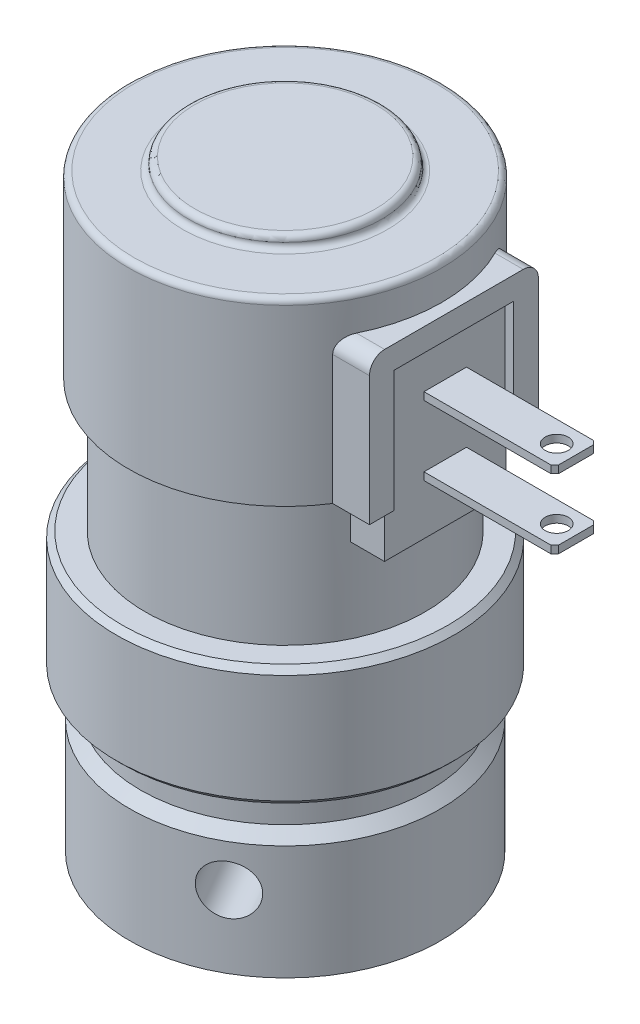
ISO-10303-21;
HEADER;
FILE_DESCRIPTION(('STEP AP214'),'2;1');
FILE_NAME('part.step','',(''),(''),'','','');
FILE_SCHEMA(('AUTOMOTIVE_DESIGN { 1 0 10303 214 1 1 1 1 }'));
ENDSEC;
DATA;
#1=APPLICATION_CONTEXT('core data for automotive mechanical design processes');
#2=APPLICATION_PROTOCOL_DEFINITION('international standard','automotive_design',2000,#1);
#3=PRODUCT_CONTEXT('',#1,'mechanical');
#4=PRODUCT('Part','Part','',(#3));
#5=PRODUCT_RELATED_PRODUCT_CATEGORY('part','',(#4));
#6=PRODUCT_DEFINITION_FORMATION('','',#4);
#7=PRODUCT_DEFINITION_CONTEXT('part definition',#1,'design');
#8=PRODUCT_DEFINITION('design','',#6,#7);
#9=PRODUCT_DEFINITION_SHAPE('','',#8);
#10=(LENGTH_UNIT() NAMED_UNIT(*) SI_UNIT(.MILLI.,.METRE.));
#11=(NAMED_UNIT(*) PLANE_ANGLE_UNIT() SI_UNIT($,.RADIAN.));
#12=(NAMED_UNIT(*) SI_UNIT($,.STERADIAN.) SOLID_ANGLE_UNIT());
#13=UNCERTAINTY_MEASURE_WITH_UNIT(LENGTH_MEASURE(1.E-05),#10,'distance_accuracy_value','');
#14=(GEOMETRIC_REPRESENTATION_CONTEXT(3) GLOBAL_UNCERTAINTY_ASSIGNED_CONTEXT((#13)) GLOBAL_UNIT_ASSIGNED_CONTEXT((#10,
#11,#12)) REPRESENTATION_CONTEXT('',''));
#15=CARTESIAN_POINT('',(0.,0.,0.));
#16=DIRECTION('',(0.,0.,1.));
#17=DIRECTION('',(1.,0.,0.));
#18=AXIS2_PLACEMENT_3D('',#15,#16,#17);
#19=CARTESIAN_POINT('',(10.541,29.5371,-4.));
#20=DIRECTION('',(1.,0.,0.));
#21=DIRECTION('',(0.,0.,-1.));
#22=AXIS2_PLACEMENT_3D('',#19,#20,#21);
#23=PLANE('',#22);
#24=DIRECTION('',(0.,1.,0.));
#25=VECTOR('',#24,1.);
#26=CARTESIAN_POINT('',(10.541,29.5371,1.4));
#27=LINE('',#26,#25);
#28=CARTESIAN_POINT('',(10.541,31.672,1.4));
#29=VERTEX_POINT('',#28);
#30=CARTESIAN_POINT('',(10.541,32.172,1.4));
#31=VERTEX_POINT('',#30);
#32=EDGE_CURVE('E198',#29,#31,#27,.T.);
#33=ORIENTED_EDGE('',*,*,#32,.T.);
#34=DIRECTION('',(0.,0.,-1.));
#35=VECTOR('',#34,1.);
#36=CARTESIAN_POINT('',(10.541,32.172,-4.));
#37=LINE('',#36,#35);
#38=CARTESIAN_POINT('',(10.541,32.172,-1.4));
#39=VERTEX_POINT('',#38);
#40=EDGE_CURVE('E752',#31,#39,#37,.T.);
#41=ORIENTED_EDGE('',*,*,#40,.T.);
#42=DIRECTION('',(0.,1.,0.));
#43=VECTOR('',#42,1.);
#44=CARTESIAN_POINT('',(10.541,29.5371,-1.4));
#45=LINE('',#44,#43);
#46=CARTESIAN_POINT('',(10.541,31.672,-1.4));
#47=VERTEX_POINT('',#46);
#48=EDGE_CURVE('E1243',#47,#39,#45,.T.);
#49=ORIENTED_EDGE('',*,*,#48,.F.);
#50=DIRECTION('',(0.,0.,-1.));
#51=VECTOR('',#50,1.);
#52=CARTESIAN_POINT('',(10.541,31.672,-4.));
#53=LINE('',#52,#51);
#54=EDGE_CURVE('E766',#29,#47,#53,.T.);
#55=ORIENTED_EDGE('',*,*,#54,.F.);
#56=EDGE_LOOP('',(#33,#41,#49,#55));
#57=FACE_BOUND('',#56,.T.);
#58=DIRECTION('',(0.,1.,0.));
#59=VECTOR('',#58,1.);
#60=CARTESIAN_POINT('',(10.541,29.5371,-4.));
#61=LINE('',#60,#59);
#62=CARTESIAN_POINT('',(10.541,23.7871,-4.));
#63=VERTEX_POINT('',#62);
#64=CARTESIAN_POINT('',(10.541,26.95,-4.));
#65=VERTEX_POINT('',#64);
#66=EDGE_CURVE('E329',#63,#65,#61,.T.);
#67=ORIENTED_EDGE('',*,*,#66,.T.);
#68=DIRECTION('',(0.,0.,1.));
#69=VECTOR('',#68,1.);
#70=CARTESIAN_POINT('',(10.541,26.95,0.));
#71=LINE('',#70,#69);
#72=CARTESIAN_POINT('',(10.541,26.95,-3.937));
#73=VERTEX_POINT('',#72);
#74=EDGE_CURVE('E355',#65,#73,#71,.T.);
#75=ORIENTED_EDGE('',*,*,#74,.T.);
#76=DIRECTION('',(0.,-1.,0.));
#77=VECTOR('',#76,1.);
#78=CARTESIAN_POINT('',(10.541,30.45,-3.937));
#79=LINE('',#78,#77);
#80=CARTESIAN_POINT('',(10.541,34.95,-3.937));
#81=VERTEX_POINT('',#80);
#82=EDGE_CURVE('E493',#81,#73,#79,.T.);
#83=ORIENTED_EDGE('',*,*,#82,.F.);
#84=DIRECTION('',(0.,0.,-1.));
#85=VECTOR('',#84,1.);
#86=CARTESIAN_POINT('',(10.541,34.95,-3.937));
#87=LINE('',#86,#85);
#88=CARTESIAN_POINT('',(10.541,34.95,3.937));
#89=VERTEX_POINT('',#88);
#90=EDGE_CURVE('E344',#89,#81,#87,.T.);
#91=ORIENTED_EDGE('',*,*,#90,.F.);
#92=DIRECTION('',(0.,1.,0.));
#93=VECTOR('',#92,1.);
#94=CARTESIAN_POINT('',(10.541,30.45,3.937));
#95=LINE('',#94,#93);
#96=CARTESIAN_POINT('',(10.541,26.95,3.937));
#97=VERTEX_POINT('',#96);
#98=EDGE_CURVE('E348',#97,#89,#95,.T.);
#99=ORIENTED_EDGE('',*,*,#98,.F.);
#100=CARTESIAN_POINT('',(10.541,26.95,4.));
#101=VERTEX_POINT('',#100);
#102=EDGE_CURVE('E352',#97,#101,#71,.T.);
#103=ORIENTED_EDGE('',*,*,#102,.T.);
#104=DIRECTION('',(0.,-1.,0.));
#105=VECTOR('',#104,1.);
#106=CARTESIAN_POINT('',(10.541,29.5371,4.));
#107=LINE('',#106,#105);
#108=CARTESIAN_POINT('',(10.541,23.7871,4.));
#109=VERTEX_POINT('',#108);
#110=EDGE_CURVE('E337',#101,#109,#107,.T.);
#111=ORIENTED_EDGE('',*,*,#110,.T.);
#112=DIRECTION('',(0.,0.,1.));
#113=VECTOR('',#112,1.);
#114=CARTESIAN_POINT('',(10.541,23.7871,-4.));
#115=LINE('',#114,#113);
#116=EDGE_CURVE('E333',#63,#109,#115,.T.);
#117=ORIENTED_EDGE('',*,*,#116,.F.);
#118=EDGE_LOOP('',(#67,#75,#83,#91,#99,#103,#111,#117));
#119=FACE_BOUND('',#118,.T.);
#120=DIRECTION('',(0.,1.,0.));
#121=VECTOR('',#120,1.);
#122=CARTESIAN_POINT('',(10.541,29.5371,1.4));
#123=LINE('',#122,#121);
#124=CARTESIAN_POINT('',(10.541,27.1,1.4));
#125=VERTEX_POINT('',#124);
#126=CARTESIAN_POINT('',(10.541,27.6,1.4));
#127=VERTEX_POINT('',#126);
#128=EDGE_CURVE('E25',#125,#127,#123,.T.);
#129=ORIENTED_EDGE('',*,*,#128,.T.);
#130=DIRECTION('',(0.,0.,-1.));
#131=VECTOR('',#130,1.);
#132=CARTESIAN_POINT('',(10.541,27.6,-4.));
#133=LINE('',#132,#131);
#134=CARTESIAN_POINT('',(10.541,27.6,-1.4));
#135=VERTEX_POINT('',#134);
#136=EDGE_CURVE('E11',#127,#135,#133,.T.);
#137=ORIENTED_EDGE('',*,*,#136,.T.);
#138=DIRECTION('',(0.,1.,0.));
#139=VECTOR('',#138,1.);
#140=CARTESIAN_POINT('',(10.541,29.5371,-1.4));
#141=LINE('',#140,#139);
#142=CARTESIAN_POINT('',(10.541,27.1,-1.4));
#143=VERTEX_POINT('',#142);
#144=EDGE_CURVE('E742',#143,#135,#141,.T.);
#145=ORIENTED_EDGE('',*,*,#144,.F.);
#146=DIRECTION('',(0.,0.,-1.));
#147=VECTOR('',#146,1.);
#148=CARTESIAN_POINT('',(10.541,27.1,-4.));
#149=LINE('',#148,#147);
#150=EDGE_CURVE('E747',#125,#143,#149,.T.);
#151=ORIENTED_EDGE('',*,*,#150,.F.);
#152=EDGE_LOOP('',(#129,#137,#145,#151));
#153=FACE_BOUND('',#152,.T.);
#154=ADVANCED_FACE('F16',(#57,#119,#153),#23,.T.);
#155=CARTESIAN_POINT('',(6.681,0.,0.));
#156=DIRECTION('',(0.,-1.,0.));
#157=DIRECTION('',(0.,0.,-1.));
#158=AXIS2_PLACEMENT_3D('',#155,#156,#157);
#159=PLANE('',#158);
#160=CARTESIAN_POINT('',(0.,0.,0.));
#161=DIRECTION('',(0.,-1.,0.));
#162=DIRECTION('',(0.,0.,-1.));
#163=AXIS2_PLACEMENT_3D('',#160,#161,#162);
#164=CIRCLE('',#163,8.83510678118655);
#165=CARTESIAN_POINT('',(0.,0.,-8.83510678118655));
#166=VERTEX_POINT('',#165);
#167=EDGE_CURVE('E763',#166,#166,#164,.T.);
#168=ORIENTED_EDGE('',*,*,#167,.F.);
#169=EDGE_LOOP('',(#168));
#170=FACE_BOUND('',#169,.T.);
#171=CARTESIAN_POINT('',(0.,0.,0.));
#172=DIRECTION('',(0.,-1.,0.));
#173=DIRECTION('',(0.,0.,-1.));
#174=AXIS2_PLACEMENT_3D('',#171,#172,#173);
#175=CIRCLE('',#174,10.2362);
#176=CARTESIAN_POINT('',(0.,0.,-10.2362));
#177=VERTEX_POINT('',#176);
#178=EDGE_CURVE('E574',#177,#177,#175,.T.);
#179=ORIENTED_EDGE('',*,*,#178,.T.);
#180=EDGE_LOOP('',(#179));
#181=FACE_BOUND('',#180,.T.);
#182=ADVANCED_FACE('F655',(#170,#181),#159,.T.);
#183=CARTESIAN_POINT('',(0.,0.,0.));
#184=DIRECTION('',(0.,-1.,0.));
#185=DIRECTION('',(0.,0.,-1.));
#186=AXIS2_PLACEMENT_3D('',#183,#184,#185);
#187=CYLINDRICAL_SURFACE('',#186,10.2362);
#188=CARTESIAN_POINT('',(0.,10.2362000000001,0.));
#189=DIRECTION('',(0.,-1.,0.));
#190=DIRECTION('',(0.,0.,-1.));
#191=AXIS2_PLACEMENT_3D('',#188,#189,#190);
#192=CIRCLE('',#191,10.2362);
#193=CARTESIAN_POINT('',(0.,10.2362000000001,-10.2362));
#194=VERTEX_POINT('',#193);
#195=EDGE_CURVE('E558',#194,#194,#192,.T.);
#196=ORIENTED_EDGE('',*,*,#195,.F.);
#197=EDGE_LOOP('',(#196));
#198=FACE_BOUND('',#197,.T.);
#199=CARTESIAN_POINT('',(0.,10.3251,0.));
#200=DIRECTION('',(0.,1.,0.));
#201=DIRECTION('',(0.,0.,1.));
#202=AXIS2_PLACEMENT_3D('',#199,#200,#201);
#203=CIRCLE('',#202,10.2362);
#204=CARTESIAN_POINT('',(0.,10.3251,10.2362));
#205=VERTEX_POINT('',#204);
#206=EDGE_CURVE('E521',#205,#205,#203,.F.);
#207=ORIENTED_EDGE('',*,*,#206,.T.);
#208=EDGE_LOOP('',(#207));
#209=FACE_BOUND('',#208,.T.);
#210=ADVANCED_FACE('F652',(#198,#209),#187,.T.);
#211=CARTESIAN_POINT('',(0.,0.,0.));
#212=DIRECTION('',(0.,-1.,0.));
#213=DIRECTION('',(0.,0.,-1.));
#214=AXIS2_PLACEMENT_3D('',#211,#212,#213);
#215=CYLINDRICAL_SURFACE('',#214,10.2362);
#216=CARTESIAN_POINT('',(-10.2362,3.1494,0.));
#217=CARTESIAN_POINT('',(-10.2361984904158,3.149403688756,0.0906989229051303));
#218=CARTESIAN_POINT('',(-10.2349819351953,3.15701633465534,0.181448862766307));
#219=CARTESIAN_POINT('',(-10.2302459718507,3.18725551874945,0.360407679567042));
#220=CARTESIAN_POINT('',(-10.2267243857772,3.20989625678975,0.448614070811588));
#221=CARTESIAN_POINT('',(-10.2177737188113,3.26949428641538,0.619870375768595));
#222=CARTESIAN_POINT('',(-10.2123461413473,3.30644029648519,0.702924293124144));
#223=CARTESIAN_POINT('',(-10.2001817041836,3.39357150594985,0.861642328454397));
#224=CARTESIAN_POINT('',(-10.1934450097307,3.44375503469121,0.937307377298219));
#225=CARTESIAN_POINT('',(-10.1793446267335,3.55640236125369,1.07977086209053));
#226=CARTESIAN_POINT('',(-10.1719764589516,3.61895885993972,1.14649556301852));
#227=CARTESIAN_POINT('',(-10.1574782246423,3.75437685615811,1.26854771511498));
#228=CARTESIAN_POINT('',(-10.1503481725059,3.82723897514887,1.32387447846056));
#229=CARTESIAN_POINT('',(-10.1370900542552,3.98170113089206,1.42185167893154));
#230=CARTESIAN_POINT('',(-10.1309677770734,4.06334747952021,1.46442995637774));
#231=CARTESIAN_POINT('',(-10.1204800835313,4.23274657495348,1.53524024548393));
#232=CARTESIAN_POINT('',(-10.1161145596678,4.32049894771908,1.56347313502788));
#233=CARTESIAN_POINT('',(-10.109678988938,4.49884040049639,1.60456048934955));
#234=CARTESIAN_POINT('',(-10.1075900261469,4.58939957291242,1.61754175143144));
#235=CARTESIAN_POINT('',(-10.1058867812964,4.77143303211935,1.62815033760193));
#236=CARTESIAN_POINT('',(-10.1062723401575,4.86290725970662,1.62577864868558));
#237=CARTESIAN_POINT('',(-10.1094572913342,5.0432736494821,1.60585210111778));
#238=CARTESIAN_POINT('',(-10.112234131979,5.13218193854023,1.58843908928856));
#239=CARTESIAN_POINT('',(-10.1198535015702,5.30579873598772,1.53914652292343));
#240=CARTESIAN_POINT('',(-10.1246960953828,5.39050711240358,1.50726651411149));
#241=CARTESIAN_POINT('',(-10.1359259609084,5.55374752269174,1.42979930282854));
#242=CARTESIAN_POINT('',(-10.1423199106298,5.63225085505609,1.38415262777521));
#243=CARTESIAN_POINT('',(-10.1559273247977,5.78053751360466,1.28049011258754));
#244=CARTESIAN_POINT('',(-10.1631408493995,5.85032019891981,1.22247336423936));
#245=CARTESIAN_POINT('',(-10.1776739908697,5.98000626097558,1.09494193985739));
#246=CARTESIAN_POINT('',(-10.1849938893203,6.03978986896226,1.02530543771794));
#247=CARTESIAN_POINT('',(-10.1988399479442,6.14684085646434,0.876924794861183));
#248=CARTESIAN_POINT('',(-10.205366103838,6.19410816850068,0.798180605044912));
#249=CARTESIAN_POINT('',(-10.2168974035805,6.27479341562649,0.633711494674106));
#250=CARTESIAN_POINT('',(-10.2219014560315,6.30820141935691,0.547981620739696));
#251=CARTESIAN_POINT('',(-10.2298158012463,6.36011197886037,0.372030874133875));
#252=CARTESIAN_POINT('',(-10.2327262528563,6.37861566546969,0.281810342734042));
#253=CARTESIAN_POINT('',(-10.2361042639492,6.40003148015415,0.100472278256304));
#254=CARTESIAN_POINT('',(-10.2365976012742,6.4031081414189,0.00937463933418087));
#255=CARTESIAN_POINT('',(-10.2351561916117,6.39402028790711,-0.172035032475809));
#256=CARTESIAN_POINT('',(-10.2332215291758,6.38185630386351,-0.262347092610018));
#257=CARTESIAN_POINT('',(-10.227157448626,6.34276928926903,-0.439118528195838));
#258=CARTESIAN_POINT('',(-10.223040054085,6.31592708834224,-0.525596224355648));
#259=CARTESIAN_POINT('',(-10.213070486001,6.24833130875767,-0.692823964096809));
#260=CARTESIAN_POINT('',(-10.2072182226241,6.20757700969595,-0.773573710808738));
#261=CARTESIAN_POINT('',(-10.1943646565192,6.11293263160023,-0.927772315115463));
#262=CARTESIAN_POINT('',(-10.1873544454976,6.05893900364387,-1.00115685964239));
#263=CARTESIAN_POINT('',(-10.1729911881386,5.93949192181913,-1.13788204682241));
#264=CARTESIAN_POINT('',(-10.1656381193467,5.87403771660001,-1.20122203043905));
#265=CARTESIAN_POINT('',(-10.1513353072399,5.73279215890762,-1.31666458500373));
#266=CARTESIAN_POINT('',(-10.1443899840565,5.6569097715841,-1.36865640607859));
#267=CARTESIAN_POINT('',(-10.1317695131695,5.49739183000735,-1.45915508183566));
#268=CARTESIAN_POINT('',(-10.1260943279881,5.41375650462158,-1.49766233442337));
#269=CARTESIAN_POINT('',(-10.1166893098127,5.24142640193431,-1.55993023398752));
#270=CARTESIAN_POINT('',(-10.1129520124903,5.15275251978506,-1.58374753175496));
#271=CARTESIAN_POINT('',(-10.1078266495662,4.97259899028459,-1.61613872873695));
#272=CARTESIAN_POINT('',(-10.1064384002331,4.88111956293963,-1.62471382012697));
#273=CARTESIAN_POINT('',(-10.1061757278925,4.69905660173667,-1.62634629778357));
#274=CARTESIAN_POINT('',(-10.1072730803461,4.60847462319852,-1.61957791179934));
#275=CARTESIAN_POINT('',(-10.1117963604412,4.42975519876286,-1.59109066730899));
#276=CARTESIAN_POINT('',(-10.1152222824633,4.34161774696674,-1.56937184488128));
#277=CARTESIAN_POINT('',(-10.124006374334,4.17034742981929,-1.51166453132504));
#278=CARTESIAN_POINT('',(-10.1293626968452,4.08720986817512,-1.47568967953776));
#279=CARTESIAN_POINT('',(-10.1414060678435,3.92812209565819,-1.39050910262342));
#280=CARTESIAN_POINT('',(-10.1480931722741,3.85217218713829,-1.34130282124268));
#281=CARTESIAN_POINT('',(-10.1621347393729,3.70873297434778,-1.23042891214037));
#282=CARTESIAN_POINT('',(-10.1694956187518,3.64134369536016,-1.16863267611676));
#283=CARTESIAN_POINT('',(-10.1840030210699,3.51783080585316,-1.03460468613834));
#284=CARTESIAN_POINT('',(-10.1911494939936,3.46170980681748,-0.962370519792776));
#285=CARTESIAN_POINT('',(-10.2044740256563,3.36201093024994,-0.808985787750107));
#286=CARTESIAN_POINT('',(-10.2106457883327,3.31851319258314,-0.727782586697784));
#287=CARTESIAN_POINT('',(-10.2212640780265,3.24584107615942,-0.559159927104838));
#288=CARTESIAN_POINT('',(-10.2257123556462,3.21665215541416,-0.47174688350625));
#289=CARTESIAN_POINT('',(-10.2313900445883,3.17990091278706,-0.319973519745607));
#290=CARTESIAN_POINT('',(-10.2331843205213,3.1684809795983,-0.256540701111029));
#291=CARTESIAN_POINT('',(-10.2355898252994,3.15322927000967,-0.128747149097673));
#292=CARTESIAN_POINT('',(-10.2362010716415,3.14939738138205,-0.0643864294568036));
#293=CARTESIAN_POINT('',(-10.2362,3.1494,0.));
#294=B_SPLINE_CURVE_WITH_KNOTS('',3,(#216,#217,#218,#219,#220,#221,#222,#223,#224,#225,#226,
#227,#228,#229,#230,#231,#232,#233,#234,#235,#236,#237,#238,#239,#240,#241,#242,#243,#244,#245,
#246,#247,#248,#249,#250,#251,#252,#253,#254,#255,#256,#257,#258,#259,#260,#261,#262,#263,#264,
#265,#266,#267,#268,#269,#270,#271,#272,#273,#274,#275,#276,#277,#278,#279,#280,#281,#282,#283,
#284,#285,#286,#287,#288,#289,#290,#291,#292,#293),.UNSPECIFIED.,.T.,.F.,(4,2,2,2,2,2,2,2,2,2,2,
2,2,2,2,2,2,2,2,2,2,2,2,2,2,2,2,2,2,2,2,2,2,2,2,2,2,2,4),(0.,0.271861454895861,
0.543980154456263,0.815884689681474,1.08775492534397,1.36174499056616,1.63575158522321,
1.91128101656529,2.18679358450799,2.45999904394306,2.7331869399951,3.00382632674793,
3.27447421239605,3.54630847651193,3.81816270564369,4.09307041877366,4.36797961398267,
4.64308546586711,4.91817044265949,5.19031523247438,5.46245054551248,5.73310214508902,
6.00376776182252,6.27662192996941,6.54949399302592,6.82492054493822,7.10033896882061,
7.37468850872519,7.64901658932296,7.92024525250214,8.19147326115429,8.46244239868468,
8.73342292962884,9.00732446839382,9.28128941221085,9.55695739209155,9.83234462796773,
10.0253397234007,10.2183319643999),.UNSPECIFIED.);
#295=CARTESIAN_POINT('',(-10.2362,3.1494,0.));
#296=VERTEX_POINT('',#295);
#297=EDGE_CURVE('E526',#296,#296,#294,.T.);
#298=ORIENTED_EDGE('',*,*,#297,.F.);
#299=EDGE_LOOP('',(#298));
#300=FACE_BOUND('',#299,.T.);
#301=CARTESIAN_POINT('',(5.1181,3.1494,-8.86480923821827));
#302=CARTESIAN_POINT('',(5.03955167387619,3.149403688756,-8.91015739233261));
#303=CARTESIAN_POINT('',(4.96035164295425,3.15701633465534,-8.95447879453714));
#304=CARTESIAN_POINT('',(4.8030007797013,3.18725551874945,-9.03985673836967));
#305=CARTESIAN_POINT('',(4.72485101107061,3.20989625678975,-9.08091015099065));
#306=CARTESIAN_POINT('',(4.57206336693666,3.26949428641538,-9.15878679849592));
#307=CARTESIAN_POINT('',(4.4974227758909,3.30644029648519,-9.19561333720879));
#308=CARTESIAN_POINT('',(4.35388670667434,3.39357150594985,-9.26443764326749));
#309=CARTESIAN_POINT('',(4.28499050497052,3.44375503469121,-9.2964360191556));
#310=CARTESIAN_POINT('',(4.15456331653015,3.55640236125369,-9.35545647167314));
#311=CARTESIAN_POINT('',(4.09309394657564,3.61895885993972,-9.38243780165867));
#312=CARTESIAN_POINT('',(3.98014456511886,3.75437685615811,-9.43090803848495));
#313=CARTESIAN_POINT('',(3.92866515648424,3.82723897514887,-9.45239661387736));
#314=CARTESIAN_POINT('',(3.83718535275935,3.98170113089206,-9.48990334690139));
#315=CARTESIAN_POINT('',(3.79725034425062,4.0633474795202,-9.50589043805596));
#316=CARTESIAN_POINT('',(3.73068298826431,4.23274657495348,-9.53221297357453));
#317=CARTESIAN_POINT('',(3.70404982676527,4.32049894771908,-9.54254876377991));
#318=CARTESIAN_POINT('',(3.6652493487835,4.49884040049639,-9.55751907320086));
#319=CARTESIAN_POINT('',(3.65296276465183,4.58939957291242,-9.56220060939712));
#320=CARTESIAN_POINT('',(3.64292383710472,4.77143303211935,-9.56602984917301));
#321=CARTESIAN_POINT('',(3.64517055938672,4.86290725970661,-9.56517790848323));
#322=CARTESIAN_POINT('',(3.66401993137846,5.0432736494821,-9.5579728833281));
#323=CARTESIAN_POINT('',(3.68048846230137,5.13218193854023,-9.55167119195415));
#324=CARTESIAN_POINT('',(3.72698676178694,5.30579873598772,-9.53362347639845));
#325=CARTESIAN_POINT('',(3.75701695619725,5.39050711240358,-9.52187728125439));
#326=CARTESIAN_POINT('',(3.82972046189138,5.55374752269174,-9.49286902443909));
#327=CARTESIAN_POINT('',(3.87244861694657,5.63225085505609,-9.4755830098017));
#328=CARTESIAN_POINT('',(3.96902669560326,5.78053751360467,-9.43553611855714));
#329=CARTESIAN_POINT('',(4.02287743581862,5.85032019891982,-9.41277483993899));
#330=CARTESIAN_POINT('',(4.14058945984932,5.98000626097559,-9.36159519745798));
#331=CARTESIAN_POINT('',(4.2045563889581,6.03978986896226,-9.33311616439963));
#332=CARTESIAN_POINT('',(4.33998082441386,6.14684085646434,-9.27091688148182));
#333=CARTESIAN_POINT('',(4.41143837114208,6.19410816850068,-9.2371966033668));
#334=CARTESIAN_POINT('',(4.55963844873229,6.27479341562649,-9.16494844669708));
#335=CARTESIAN_POINT('',(4.63638472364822,6.30820141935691,-9.1264171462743));
#336=CARTESIAN_POINT('',(4.7927197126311,6.36011197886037,-9.04529579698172));
#337=CARTESIAN_POINT('',(4.87230821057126,6.37861566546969,-9.0027060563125));
#338=CARTESIAN_POINT('',(5.03104058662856,6.40003148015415,-8.9149624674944));
#339=CARTESIAN_POINT('',(5.11018012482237,6.4031081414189,-8.86984089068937));
#340=CARTESIAN_POINT('',(5.26656480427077,6.39402028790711,-8.7778877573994));
#341=CARTESIAN_POINT('',(5.34381001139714,6.38185630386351,-8.73105626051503));
#342=CARTESIAN_POINT('',(5.49386652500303,6.34276928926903,-8.63741889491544));
#343=CARTESIAN_POINT('',(5.56669970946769,6.31592708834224,-8.59061427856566));
#344=CARTESIAN_POINT('',(5.70653839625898,6.24833130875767,-8.49836650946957));
#345=CARTESIAN_POINT('',(5.77354359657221,6.20757700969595,-8.45292342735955));
#346=CARTESIAN_POINT('',(5.90065672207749,6.11293263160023,-8.36469261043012));
#347=CARTESIAN_POINT('',(5.96070449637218,6.05893900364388,-8.3219293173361));
#348=CARTESIAN_POINT('',(6.07193035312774,5.93949192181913,-8.24112777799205));
#349=CARTESIAN_POINT('',(6.12310785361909,5.87403771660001,-8.20308984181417));
#350=CARTESIAN_POINT('',(6.21593263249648,5.73279215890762,-8.1329819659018));
#351=CARTESIAN_POINT('',(6.25748620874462,5.6569097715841,-8.10097122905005));
#352=CARTESIAN_POINT('',(6.32955012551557,5.49739183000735,-8.04479224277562));
#353=CARTESIAN_POINT('',(6.3600607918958,5.41375650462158,-8.02062376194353));
#354=CARTESIAN_POINT('',(6.40928386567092,5.24142640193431,-7.98134482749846));
#355=CARTESIAN_POINT('',(6.42804160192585,5.15275251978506,-7.96619958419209));
#356=CARTESIAN_POINT('',(6.45353051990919,4.97259899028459,-7.94556529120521));
#357=CARTESIAN_POINT('',(6.46026264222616,4.88111956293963,-7.94007548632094));
#358=CARTESIAN_POINT('',(6.46154507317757,4.69905660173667,-7.93903176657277));
#359=CARTESIAN_POINT('',(6.45623215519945,4.60847462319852,-7.94336629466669));
#360=CARTESIAN_POINT('',(6.43382311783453,4.42975519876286,-7.96152719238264));
#361=CARTESIAN_POINT('',(6.41672702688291,4.34161774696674,-7.97535353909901));
#362=CARTESIAN_POINT('',(6.37114307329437,4.17034742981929,-8.01181444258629));
#363=CARTESIAN_POINT('',(6.34266609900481,4.08720986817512,-8.0344405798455));
#364=CARTESIAN_POINT('',(6.27491924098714,3.9281220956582,-8.08746073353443));
#365=CARTESIAN_POINT('',(6.23564890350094,3.85217218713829,-8.11785507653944));
#366=CARTESIAN_POINT('',(6.14665006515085,3.70873297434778,-8.18545238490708));
#367=CARTESIAN_POINT('',(6.09681339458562,3.64134369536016,-8.22272521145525));
#368=CARTESIAN_POINT('',(5.98799545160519,3.51783080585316,-8.30230298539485));
#369=CARTESIAN_POINT('',(5.92901206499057,3.46170980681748,-8.34460909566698));
#370=CARTESIAN_POINT('',(5.80283925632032,3.36201093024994,-8.43284084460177));
#371=CARTESIAN_POINT('',(5.73560110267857,3.31851319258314,-8.47878734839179));
#372=CARTESIAN_POINT('',(5.5948787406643,3.24584107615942,-8.57229438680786));
#373=CARTESIAN_POINT('',(5.52140096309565,3.21665215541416,-8.61985323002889));
#374=CARTESIAN_POINT('',(5.39280021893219,3.17990091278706,-8.7006569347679));
#375=CARTESIAN_POINT('',(5.33876292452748,3.1684809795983,-8.73392723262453));
#376=CARTESIAN_POINT('',(5.22929321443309,3.15322927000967,-8.79990723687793));
#377=CARTESIAN_POINT('',(5.17386081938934,3.14939738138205,-8.83261695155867));
#378=CARTESIAN_POINT('',(5.1181,3.1494,-8.86480923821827));
#379=B_SPLINE_CURVE_WITH_KNOTS('',3,(#301,#302,#303,#304,#305,#306,#307,#308,#309,#310,#311,
#312,#313,#314,#315,#316,#317,#318,#319,#320,#321,#322,#323,#324,#325,#326,#327,#328,#329,#330,
#331,#332,#333,#334,#335,#336,#337,#338,#339,#340,#341,#342,#343,#344,#345,#346,#347,#348,#349,
#350,#351,#352,#353,#354,#355,#356,#357,#358,#359,#360,#361,#362,#363,#364,#365,#366,#367,#368,
#369,#370,#371,#372,#373,#374,#375,#376,#377,#378),.UNSPECIFIED.,.T.,.F.,(4,2,2,2,2,2,2,2,2,2,2,
2,2,2,2,2,2,2,2,2,2,2,2,2,2,2,2,2,2,2,2,2,2,2,2,2,2,2,4),(0.,0.271861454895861,
0.543980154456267,0.815884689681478,1.08775492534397,1.36174499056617,1.63575158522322,
1.91128101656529,2.18679358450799,2.45999904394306,2.73318693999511,3.00382632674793,
3.27447421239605,3.54630847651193,3.8181627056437,4.09307041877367,4.36797961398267,
4.64308546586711,4.9181704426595,5.19031523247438,5.46245054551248,5.73310214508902,
6.00376776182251,6.27662192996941,6.54949399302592,6.82492054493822,7.10033896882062,
7.37468850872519,7.64901658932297,7.92024525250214,8.19147326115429,8.46244239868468,
8.73342292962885,9.00732446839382,9.28128941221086,9.55695739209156,9.83234462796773,
10.0253397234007,10.2183319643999),.UNSPECIFIED.);
#380=CARTESIAN_POINT('',(5.1181,3.1494,-8.86480923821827));
#381=VERTEX_POINT('',#380);
#382=EDGE_CURVE('E531',#381,#381,#379,.T.);
#383=ORIENTED_EDGE('',*,*,#382,.F.);
#384=EDGE_LOOP('',(#383));
#385=FACE_BOUND('',#384,.T.);
#386=CARTESIAN_POINT('',(5.1181,3.1494,8.86480923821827));
#387=CARTESIAN_POINT('',(5.19664681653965,3.149403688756,8.81945846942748));
#388=CARTESIAN_POINT('',(5.27463029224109,3.15701633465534,8.77302993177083));
#389=CARTESIAN_POINT('',(5.42724519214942,3.18725551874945,8.67944905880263));
#390=CARTESIAN_POINT('',(5.50187337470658,3.20989625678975,8.63229608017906));
#391=CARTESIAN_POINT('',(5.64571035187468,3.26949428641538,8.53891642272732));
#392=CARTESIAN_POINT('',(5.71492336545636,3.30644029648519,8.49268904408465));
#393=CARTESIAN_POINT('',(5.84629499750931,3.39357150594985,8.40279531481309));
#394=CARTESIAN_POINT('',(5.90845450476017,3.44375503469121,8.35912864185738));
#395=CARTESIAN_POINT('',(6.0247813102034,3.55640236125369,8.27568560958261));
#396=CARTESIAN_POINT('',(6.07888251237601,3.61895885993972,8.23594223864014));
#397=CARTESIAN_POINT('',(6.17733365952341,3.75437685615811,8.16236032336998));
#398=CARTESIAN_POINT('',(6.22168301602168,3.82723897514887,8.12852213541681));
#399=CARTESIAN_POINT('',(6.29990470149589,3.98170113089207,8.06805166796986));
#400=CARTESIAN_POINT('',(6.33371743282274,4.06334747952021,8.04146048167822));
#401=CARTESIAN_POINT('',(6.389797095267,4.23274657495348,7.9969727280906));
#402=CARTESIAN_POINT('',(6.41206473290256,4.32049894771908,7.97907562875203));
#403=CARTESIAN_POINT('',(6.4444296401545,4.49884040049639,7.95295858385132));
#404=CARTESIAN_POINT('',(6.45462726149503,4.58939957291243,7.94465885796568));
#405=CARTESIAN_POINT('',(6.46296294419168,4.77143303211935,7.93787951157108));
#406=CARTESIAN_POINT('',(6.46110178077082,4.86290725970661,7.93939925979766));
#407=CARTESIAN_POINT('',(6.4454373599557,5.0432736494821,7.95212078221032));
#408=CARTESIAN_POINT('',(6.4317456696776,5.13218193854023,7.96323210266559));
#409=CARTESIAN_POINT('',(6.3928667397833,5.30579873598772,7.99447695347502));
#410=CARTESIAN_POINT('',(6.36767913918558,5.39050711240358,8.01461076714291));
#411=CARTESIAN_POINT('',(6.30620549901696,5.55374752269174,8.06306972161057));
#412=CARTESIAN_POINT('',(6.26987129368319,5.63225085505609,8.0914303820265));
#413=CARTESIAN_POINT('',(6.18690062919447,5.78053751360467,8.15504600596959));
#414=CARTESIAN_POINT('',(6.14026341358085,5.85032019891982,8.19030147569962));
#415=CARTESIAN_POINT('',(6.03708453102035,5.98000626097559,8.26665325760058));
#416=CARTESIAN_POINT('',(5.98043750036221,6.03978986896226,8.30781072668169));
#417=CARTESIAN_POINT('',(5.85885912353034,6.14684085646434,8.39399208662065));
#418=CARTESIAN_POINT('',(5.79392773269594,6.19410816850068,8.4390159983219));
#419=CARTESIAN_POINT('',(5.65725895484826,6.27479341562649,8.53123695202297));
#420=CARTESIAN_POINT('',(5.58551673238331,6.30820141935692,8.5784355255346));
#421=CARTESIAN_POINT('',(5.43709608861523,6.36011197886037,8.67326492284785));
#422=CARTESIAN_POINT('',(5.36041804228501,6.37861566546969,8.72089571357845));
#423=CARTESIAN_POINT('',(5.20506367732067,6.40003148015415,8.81449018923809));
#424=CARTESIAN_POINT('',(5.1264174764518,6.4031081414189,8.8604662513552));
#425=CARTESIAN_POINT('',(4.96859138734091,6.39402028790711,8.94992278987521));
#426=CARTESIAN_POINT('',(4.8894115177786,6.38185630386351,8.99340335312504));
#427=CARTESIAN_POINT('',(4.73329092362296,6.34276928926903,9.07653742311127));
#428=CARTESIAN_POINT('',(4.65634034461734,6.31592708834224,9.11621050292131));
#429=CARTESIAN_POINT('',(4.50653208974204,6.24833130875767,9.19119047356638));
#430=CARTESIAN_POINT('',(4.43367462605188,6.20757700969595,9.22649713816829));
#431=CARTESIAN_POINT('',(4.29370793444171,6.11293263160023,9.29246492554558));
#432=CARTESIAN_POINT('',(4.22664994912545,6.05893900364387,9.32308617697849));
#433=CARTESIAN_POINT('',(4.10106083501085,5.93949192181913,9.37900982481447));
#434=CARTESIAN_POINT('',(4.0425302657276,5.87403771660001,9.40431187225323));
#435=CARTESIAN_POINT('',(3.93540267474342,5.73279215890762,9.44964655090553));
#436=CARTESIAN_POINT('',(3.88690377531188,5.6569097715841,9.46962763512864));
#437=CARTESIAN_POINT('',(3.80221938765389,5.49739183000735,9.50394732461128));
#438=CARTESIAN_POINT('',(3.76603353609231,5.41375650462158,9.51828609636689));
#439=CARTESIAN_POINT('',(3.70740544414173,5.2414264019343,9.54127506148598));
#440=CARTESIAN_POINT('',(3.68491041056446,5.15275251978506,9.54994711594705));
#441=CARTESIAN_POINT('',(3.65429612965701,4.97259899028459,9.56170401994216));
#442=CARTESIAN_POINT('',(3.64617575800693,4.88111956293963,9.56478930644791));
#443=CARTESIAN_POINT('',(3.64463065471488,4.69905660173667,9.56537806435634));
#444=CARTESIAN_POINT('',(3.65104092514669,4.60847462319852,9.56294420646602));
#445=CARTESIAN_POINT('',(3.6779732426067,4.42975519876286,9.55261785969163));
#446=CARTESIAN_POINT('',(3.69849525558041,4.34161774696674,9.54472538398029));
#447=CARTESIAN_POINT('',(3.7528633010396,4.17034742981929,9.52347897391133));
#448=CARTESIAN_POINT('',(3.78669659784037,4.08720986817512,9.51013025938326));
#449=CARTESIAN_POINT('',(3.86648682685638,3.9281220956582,9.47796983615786));
#450=CARTESIAN_POINT('',(3.91244426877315,3.85217218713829,9.45915789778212));
#451=CARTESIAN_POINT('',(4.01548467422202,3.70873297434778,9.41588129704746));
#452=CARTESIAN_POINT('',(4.0726822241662,3.64134369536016,9.39135788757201));
#453=CARTESIAN_POINT('',(4.19600756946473,3.51783080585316,9.3369076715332));
#454=CARTESIAN_POINT('',(4.26213742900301,3.46170980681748,9.30697961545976));
#455=CARTESIAN_POINT('',(4.40163476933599,3.36201093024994,9.24182663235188));
#456=CARTESIAN_POINT('',(4.4750446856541,3.31851319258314,9.20656993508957));
#457=CARTESIAN_POINT('',(4.62638533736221,3.24584107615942,9.1314543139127));
#458=CARTESIAN_POINT('',(4.70431139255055,3.21665215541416,9.09160011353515));
#459=CARTESIAN_POINT('',(4.83858982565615,3.17990091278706,9.02063045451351));
#460=CARTESIAN_POINT('',(4.89442139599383,3.1684809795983,8.99046793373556));
#461=CARTESIAN_POINT('',(5.00629661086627,3.15322927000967,8.9286543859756));
#462=CARTESIAN_POINT('',(5.0623402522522,3.14939738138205,8.89700338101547));
#463=CARTESIAN_POINT('',(5.1181,3.1494,8.86480923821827));
#464=B_SPLINE_CURVE_WITH_KNOTS('',3,(#386,#387,#388,#389,#390,#391,#392,#393,#394,#395,#396,
#397,#398,#399,#400,#401,#402,#403,#404,#405,#406,#407,#408,#409,#410,#411,#412,#413,#414,#415,
#416,#417,#418,#419,#420,#421,#422,#423,#424,#425,#426,#427,#428,#429,#430,#431,#432,#433,#434,
#435,#436,#437,#438,#439,#440,#441,#442,#443,#444,#445,#446,#447,#448,#449,#450,#451,#452,#453,
#454,#455,#456,#457,#458,#459,#460,#461,#462,#463),.UNSPECIFIED.,.T.,.F.,(4,2,2,2,2,2,2,2,2,2,2,
2,2,2,2,2,2,2,2,2,2,2,2,2,2,2,2,2,2,2,2,2,2,2,2,2,2,2,4),(0.,0.27186145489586,0.543980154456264,
0.815884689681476,1.08775492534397,1.36174499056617,1.63575158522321,1.91128101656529,
2.18679358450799,2.45999904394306,2.7331869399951,3.00382632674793,3.27447421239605,
3.54630847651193,3.8181627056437,4.09307041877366,4.36797961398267,4.64308546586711,
4.91817044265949,5.19031523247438,5.46245054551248,5.73310214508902,6.00376776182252,
6.27662192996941,6.54949399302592,6.82492054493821,7.10033896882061,7.37468850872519,
7.64901658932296,7.92024525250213,8.19147326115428,8.46244239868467,8.73342292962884,
9.00732446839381,9.28128941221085,9.55695739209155,9.83234462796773,10.0253397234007,
10.2183319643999),.UNSPECIFIED.);
#465=CARTESIAN_POINT('',(5.1181,3.1494,8.86480923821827));
#466=VERTEX_POINT('',#465);
#467=EDGE_CURVE('E536',#466,#466,#464,.T.);
#468=ORIENTED_EDGE('',*,*,#467,.F.);
#469=EDGE_LOOP('',(#468));
#470=FACE_BOUND('',#469,.T.);
#471=CARTESIAN_POINT('',(0.,7.5268,0.));
#472=DIRECTION('',(0.,-1.,0.));
#473=DIRECTION('',(0.,0.,-1.));
#474=AXIS2_PLACEMENT_3D('',#471,#472,#473);
#475=CIRCLE('',#474,10.2362);
#476=CARTESIAN_POINT('',(0.,7.5268,-10.2362));
#477=VERTEX_POINT('',#476);
#478=EDGE_CURVE('E570',#477,#477,#475,.T.);
#479=ORIENTED_EDGE('',*,*,#478,.T.);
#480=EDGE_LOOP('',(#479));
#481=FACE_BOUND('',#480,.T.);
#482=ORIENTED_EDGE('',*,*,#178,.F.);
#483=EDGE_LOOP('',(#482));
#484=FACE_BOUND('',#483,.T.);
#485=ADVANCED_FACE('F608',(#300,#385,#470,#481,#484),#215,.T.);
#486=CARTESIAN_POINT('',(0.,7.5268,0.));
#487=DIRECTION('',(0.,-1.,0.));
#488=DIRECTION('',(0.,0.,-1.));
#489=AXIS2_PLACEMENT_3D('',#486,#487,#488);
#490=CONICAL_SURFACE('',#489,10.2362,0.785398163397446);
#491=CARTESIAN_POINT('',(0.,8.238,0.));
#492=DIRECTION('',(0.,-1.,0.));
#493=DIRECTION('',(0.,0.,-1.));
#494=AXIS2_PLACEMENT_3D('',#491,#492,#493);
#495=CIRCLE('',#494,9.525);
#496=CARTESIAN_POINT('',(0.,8.238,-9.525));
#497=VERTEX_POINT('',#496);
#498=EDGE_CURVE('E566',#497,#497,#495,.T.);
#499=ORIENTED_EDGE('',*,*,#498,.T.);
#500=EDGE_LOOP('',(#499));
#501=FACE_BOUND('',#500,.T.);
#502=ORIENTED_EDGE('',*,*,#478,.F.);
#503=EDGE_LOOP('',(#502));
#504=FACE_BOUND('',#503,.T.);
#505=ADVANCED_FACE('F663',(#501,#504),#490,.T.);
#506=CARTESIAN_POINT('',(0.,0.,0.));
#507=DIRECTION('',(0.,-1.,0.));
#508=DIRECTION('',(0.,0.,-1.));
#509=AXIS2_PLACEMENT_3D('',#506,#507,#508);
#510=CYLINDRICAL_SURFACE('',#509,9.525);
#511=CARTESIAN_POINT('',(0.,9.525,0.));
#512=DIRECTION('',(0.,-1.,0.));
#513=DIRECTION('',(0.,0.,-1.));
#514=AXIS2_PLACEMENT_3D('',#511,#512,#513);
#515=CIRCLE('',#514,9.525);
#516=CARTESIAN_POINT('',(0.,9.525,-9.525));
#517=VERTEX_POINT('',#516);
#518=EDGE_CURVE('E562',#517,#517,#515,.T.);
#519=ORIENTED_EDGE('',*,*,#518,.T.);
#520=EDGE_LOOP('',(#519));
#521=FACE_BOUND('',#520,.T.);
#522=ORIENTED_EDGE('',*,*,#498,.F.);
#523=EDGE_LOOP('',(#522));
#524=FACE_BOUND('',#523,.T.);
#525=ADVANCED_FACE('F660',(#521,#524),#510,.T.);
#526=CARTESIAN_POINT('',(0.,10.2362000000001,0.));
#527=DIRECTION('',(0.,1.,0.));
#528=DIRECTION('',(0.,0.,1.));
#529=AXIS2_PLACEMENT_3D('',#526,#527,#528);
#530=CONICAL_SURFACE('',#529,10.2362,0.785398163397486);
#531=ORIENTED_EDGE('',*,*,#518,.F.);
#532=EDGE_LOOP('',(#531));
#533=FACE_BOUND('',#532,.T.);
#534=ORIENTED_EDGE('',*,*,#195,.T.);
#535=EDGE_LOOP('',(#534));
#536=FACE_BOUND('',#535,.T.);
#537=ADVANCED_FACE('F657',(#533,#536),#530,.T.);
#538=CARTESIAN_POINT('',(2.618125,4.775,4.53472552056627));
#539=DIRECTION('',(-0.5,0.,-0.866025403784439));
#540=DIRECTION('',(-0.866025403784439,0.,0.5));
#541=AXIS2_PLACEMENT_3D('',#538,#539,#540);
#542=PLANE('',#541);
#543=CARTESIAN_POINT('',(2.618125,4.775,4.53472552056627));
#544=DIRECTION('',(0.5,0.,0.866025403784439));
#545=DIRECTION('',(0.,-1.,0.));
#546=AXIS2_PLACEMENT_3D('',#543,#544,#545);
#547=CIRCLE('',#546,1.6256);
#548=CARTESIAN_POINT('',(2.618125,3.1494,4.53472552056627));
#549=VERTEX_POINT('',#548);
#550=EDGE_CURVE('E532',#549,#549,#547,.T.);
#551=ORIENTED_EDGE('',*,*,#550,.T.);
#552=EDGE_LOOP('',(#551));
#553=FACE_BOUND('',#552,.T.);
#554=ADVANCED_FACE('F618',(#553),#542,.F.);
#555=CARTESIAN_POINT('',(5.618125,4.775,9.7308779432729));
#556=DIRECTION('',(-0.5,0.,-0.866025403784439));
#557=DIRECTION('',(0.,-1.,0.));
#558=AXIS2_PLACEMENT_3D('',#555,#556,#557);
#559=CYLINDRICAL_SURFACE('',#558,1.6256);
#560=ORIENTED_EDGE('',*,*,#467,.T.);
#561=EDGE_LOOP('',(#560));
#562=FACE_BOUND('',#561,.T.);
#563=ORIENTED_EDGE('',*,*,#550,.F.);
#564=EDGE_LOOP('',(#563));
#565=FACE_BOUND('',#564,.T.);
#566=ADVANCED_FACE('F612',(#562,#565),#559,.F.);
#567=CARTESIAN_POINT('',(2.618125,4.775,-4.53472552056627));
#568=DIRECTION('',(-0.5,0.,0.866025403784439));
#569=DIRECTION('',(0.866025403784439,0.,0.5));
#570=AXIS2_PLACEMENT_3D('',#567,#568,#569);
#571=PLANE('',#570);
#572=CARTESIAN_POINT('',(2.618125,4.775,-4.53472552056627));
#573=DIRECTION('',(0.5,0.,-0.866025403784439));
#574=DIRECTION('',(0.,-1.,0.));
#575=AXIS2_PLACEMENT_3D('',#572,#573,#574);
#576=CIRCLE('',#575,1.6256);
#577=CARTESIAN_POINT('',(2.618125,3.1494,-4.53472552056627));
#578=VERTEX_POINT('',#577);
#579=EDGE_CURVE('E527',#578,#578,#576,.T.);
#580=ORIENTED_EDGE('',*,*,#579,.T.);
#581=EDGE_LOOP('',(#580));
#582=FACE_BOUND('',#581,.T.);
#583=ADVANCED_FACE('F617',(#582),#571,.F.);
#584=CARTESIAN_POINT('',(5.618125,4.775,-9.7308779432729));
#585=DIRECTION('',(-0.5,0.,0.866025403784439));
#586=DIRECTION('',(0.,-1.,0.));
#587=AXIS2_PLACEMENT_3D('',#584,#585,#586);
#588=CYLINDRICAL_SURFACE('',#587,1.6256);
#589=ORIENTED_EDGE('',*,*,#382,.T.);
#590=EDGE_LOOP('',(#589));
#591=FACE_BOUND('',#590,.T.);
#592=ORIENTED_EDGE('',*,*,#579,.F.);
#593=EDGE_LOOP('',(#592));
#594=FACE_BOUND('',#593,.T.);
#595=ADVANCED_FACE('F1267',(#591,#594),#588,.F.);
#596=CARTESIAN_POINT('',(-5.23625,4.775,0.));
#597=DIRECTION('',(1.,0.,0.));
#598=DIRECTION('',(0.,0.,-1.));
#599=AXIS2_PLACEMENT_3D('',#596,#597,#598);
#600=PLANE('',#599);
#601=CARTESIAN_POINT('',(-5.23625,4.775,0.));
#602=DIRECTION('',(-1.,0.,0.));
#603=DIRECTION('',(0.,-1.,0.));
#604=AXIS2_PLACEMENT_3D('',#601,#602,#603);
#605=CIRCLE('',#604,1.6256);
#606=CARTESIAN_POINT('',(-5.23625,3.1494,0.));
#607=VERTEX_POINT('',#606);
#608=EDGE_CURVE('E522',#607,#607,#605,.T.);
#609=ORIENTED_EDGE('',*,*,#608,.T.);
#610=EDGE_LOOP('',(#609));
#611=FACE_BOUND('',#610,.T.);
#612=ADVANCED_FACE('F1263',(#611),#600,.F.);
#613=CARTESIAN_POINT('',(-11.23625,4.775,0.));
#614=DIRECTION('',(1.,0.,0.));
#615=DIRECTION('',(0.,-1.,0.));
#616=AXIS2_PLACEMENT_3D('',#613,#614,#615);
#617=CYLINDRICAL_SURFACE('',#616,1.6256);
#618=ORIENTED_EDGE('',*,*,#297,.T.);
#619=EDGE_LOOP('',(#618));
#620=FACE_BOUND('',#619,.T.);
#621=ORIENTED_EDGE('',*,*,#608,.F.);
#622=EDGE_LOOP('',(#621));
#623=FACE_BOUND('',#622,.T.);
#624=ADVANCED_FACE('F1257',(#620,#623),#617,.F.);
#625=CARTESIAN_POINT('',(0.,18.2499,0.));
#626=DIRECTION('',(0.,-1.,0.));
#627=DIRECTION('',(0.,0.,-1.));
#628=AXIS2_PLACEMENT_3D('',#625,#626,#627);
#629=PLANE('',#628);
#630=CARTESIAN_POINT('',(0.,18.2499,0.));
#631=DIRECTION('',(0.,-1.,0.));
#632=DIRECTION('',(0.,0.,-1.));
#633=AXIS2_PLACEMENT_3D('',#630,#631,#632);
#634=CIRCLE('',#633,9.22);
#635=CARTESIAN_POINT('',(0.,18.2499,-9.22));
#636=VERTEX_POINT('',#635);
#637=EDGE_CURVE('E504',#636,#636,#634,.T.);
#638=ORIENTED_EDGE('',*,*,#637,.T.);
#639=EDGE_LOOP('',(#638));
#640=FACE_BOUND('',#639,.T.);
#641=CARTESIAN_POINT('',(0.,18.2499,0.));
#642=DIRECTION('',(0.,-1.,0.));
#643=DIRECTION('',(0.,0.,-1.));
#644=AXIS2_PLACEMENT_3D('',#641,#642,#643);
#645=CIRCLE('',#644,10.7315);
#646=CARTESIAN_POINT('',(0.,18.2499,-10.7315));
#647=VERTEX_POINT('',#646);
#648=EDGE_CURVE('E505',#647,#647,#645,.T.);
#649=ORIENTED_EDGE('',*,*,#648,.F.);
#650=EDGE_LOOP('',(#649));
#651=FACE_BOUND('',#650,.T.);
#652=ADVANCED_FACE('F1262',(#640,#651),#629,.F.);
#653=CARTESIAN_POINT('',(10.7315,10.3251,0.));
#654=DIRECTION('',(0.,1.,0.));
#655=DIRECTION('',(0.,0.,1.));
#656=AXIS2_PLACEMENT_3D('',#653,#654,#655);
#657=PLANE('',#656);
#658=ORIENTED_EDGE('',*,*,#206,.F.);
#659=EDGE_LOOP('',(#658));
#660=FACE_BOUND('',#659,.T.);
#661=CARTESIAN_POINT('',(0.,10.3251,0.));
#662=DIRECTION('',(0.,-1.,0.));
#663=DIRECTION('',(0.,0.,-1.));
#664=AXIS2_PLACEMENT_3D('',#661,#662,#663);
#665=CIRCLE('',#664,10.7315);
#666=CARTESIAN_POINT('',(0.,10.3251,-10.7315));
#667=VERTEX_POINT('',#666);
#668=EDGE_CURVE('E517',#667,#667,#665,.T.);
#669=ORIENTED_EDGE('',*,*,#668,.T.);
#670=EDGE_LOOP('',(#669));
#671=FACE_BOUND('',#670,.T.);
#672=ADVANCED_FACE('F1332',(#660,#671),#657,.F.);
#673=CARTESIAN_POINT('',(0.,10.3251,0.));
#674=DIRECTION('',(0.,1.,0.));
#675=DIRECTION('',(0.,0.,1.));
#676=AXIS2_PLACEMENT_3D('',#673,#674,#675);
#677=CONICAL_SURFACE('',#676,10.7315,0.785398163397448);
#678=CARTESIAN_POINT('',(0.,10.7061,0.));
#679=DIRECTION('',(0.,-1.,0.));
#680=DIRECTION('',(0.,0.,-1.));
#681=AXIS2_PLACEMENT_3D('',#678,#679,#680);
#682=CIRCLE('',#681,11.1125);
#683=CARTESIAN_POINT('',(0.,10.7061,-11.1125));
#684=VERTEX_POINT('',#683);
#685=EDGE_CURVE('E513',#684,#684,#682,.T.);
#686=ORIENTED_EDGE('',*,*,#685,.T.);
#687=EDGE_LOOP('',(#686));
#688=FACE_BOUND('',#687,.T.);
#689=ORIENTED_EDGE('',*,*,#668,.F.);
#690=EDGE_LOOP('',(#689));
#691=FACE_BOUND('',#690,.T.);
#692=ADVANCED_FACE('F1342',(#688,#691),#677,.T.);
#693=CARTESIAN_POINT('',(0.,0.,0.));
#694=DIRECTION('',(0.,-1.,0.));
#695=DIRECTION('',(0.,0.,-1.));
#696=AXIS2_PLACEMENT_3D('',#693,#694,#695);
#697=CYLINDRICAL_SURFACE('',#696,11.1125);
#698=CARTESIAN_POINT('',(0.,17.8689,0.));
#699=DIRECTION('',(0.,-1.,0.));
#700=DIRECTION('',(0.,0.,-1.));
#701=AXIS2_PLACEMENT_3D('',#698,#699,#700);
#702=CIRCLE('',#701,11.1125);
#703=CARTESIAN_POINT('',(0.,17.8689,-11.1125));
#704=VERTEX_POINT('',#703);
#705=EDGE_CURVE('E509',#704,#704,#702,.T.);
#706=ORIENTED_EDGE('',*,*,#705,.T.);
#707=EDGE_LOOP('',(#706));
#708=FACE_BOUND('',#707,.T.);
#709=ORIENTED_EDGE('',*,*,#685,.F.);
#710=EDGE_LOOP('',(#709));
#711=FACE_BOUND('',#710,.T.);
#712=ADVANCED_FACE('F1353',(#708,#711),#697,.T.);
#713=CARTESIAN_POINT('',(0.,18.2499,0.));
#714=DIRECTION('',(0.,-1.,0.));
#715=DIRECTION('',(0.,0.,-1.));
#716=AXIS2_PLACEMENT_3D('',#713,#714,#715);
#717=CONICAL_SURFACE('',#716,10.7315,0.785398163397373);
#718=ORIENTED_EDGE('',*,*,#705,.F.);
#719=EDGE_LOOP('',(#718));
#720=FACE_BOUND('',#719,.T.);
#721=ORIENTED_EDGE('',*,*,#648,.T.);
#722=EDGE_LOOP('',(#721));
#723=FACE_BOUND('',#722,.T.);
#724=ADVANCED_FACE('F1364',(#720,#723),#717,.T.);
#725=CARTESIAN_POINT('',(0.,0.,0.));
#726=DIRECTION('',(0.,-1.,0.));
#727=DIRECTION('',(0.,0.,-1.));
#728=AXIS2_PLACEMENT_3D('',#725,#726,#727);
#729=CYLINDRICAL_SURFACE('',#728,9.22);
#730=CARTESIAN_POINT('',(0.,26.95,0.));
#731=DIRECTION('',(0.,-1.,0.));
#732=DIRECTION('',(0.,0.,-1.));
#733=AXIS2_PLACEMENT_3D('',#730,#731,#732);
#734=CIRCLE('',#733,9.22);
#735=CARTESIAN_POINT('',(8.30712946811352,26.95,-4.));
#736=VERTEX_POINT('',#735);
#737=CARTESIAN_POINT('',(8.30712946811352,26.95,4.));
#738=VERTEX_POINT('',#737);
#739=EDGE_CURVE('E717',#736,#738,#734,.F.);
#740=ORIENTED_EDGE('',*,*,#739,.F.);
#741=DIRECTION('',(0.,-1.,0.));
#742=VECTOR('',#741,1.);
#743=CARTESIAN_POINT('',(8.30712946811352,0.,-4.));
#744=LINE('',#743,#742);
#745=CARTESIAN_POINT('',(8.30712946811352,23.7871,-4.));
#746=VERTEX_POINT('',#745);
#747=EDGE_CURVE('E593',#746,#736,#744,.F.);
#748=ORIENTED_EDGE('',*,*,#747,.F.);
#749=CARTESIAN_POINT('',(0.,23.7871,0.));
#750=DIRECTION('',(0.,-1.,0.));
#751=DIRECTION('',(0.,0.,-1.));
#752=AXIS2_PLACEMENT_3D('',#749,#750,#751);
#753=CIRCLE('',#752,9.22);
#754=CARTESIAN_POINT('',(8.30712946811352,23.7871,4.));
#755=VERTEX_POINT('',#754);
#756=EDGE_CURVE('E801',#755,#746,#753,.F.);
#757=ORIENTED_EDGE('',*,*,#756,.F.);
#758=DIRECTION('',(0.,-1.,0.));
#759=VECTOR('',#758,1.);
#760=CARTESIAN_POINT('',(8.30712946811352,0.,4.));
#761=LINE('',#760,#759);
#762=EDGE_CURVE('E720',#738,#755,#761,.T.);
#763=ORIENTED_EDGE('',*,*,#762,.F.);
#764=EDGE_LOOP('',(#740,#748,#757,#763));
#765=FACE_BOUND('',#764,.T.);
#766=ORIENTED_EDGE('',*,*,#637,.F.);
#767=EDGE_LOOP('',(#766));
#768=FACE_BOUND('',#767,.T.);
#769=ADVANCED_FACE('F1375',(#765,#768),#729,.T.);
#770=CARTESIAN_POINT('',(0.,26.95,0.));
#771=DIRECTION('',(0.,-1.,0.));
#772=DIRECTION('',(0.,0.,-1.));
#773=AXIS2_PLACEMENT_3D('',#770,#771,#772);
#774=PLANE('',#773);
#775=DIRECTION('',(1.,0.,0.));
#776=VECTOR('',#775,1.);
#777=CARTESIAN_POINT('',(0.,26.95,-4.));
#778=LINE('',#777,#776);
#779=EDGE_CURVE('E501',#736,#65,#778,.T.);
#780=ORIENTED_EDGE('',*,*,#779,.F.);
#781=ORIENTED_EDGE('',*,*,#739,.T.);
#782=DIRECTION('',(-1.,0.,0.));
#783=VECTOR('',#782,1.);
#784=CARTESIAN_POINT('',(0.,26.95,4.));
#785=LINE('',#784,#783);
#786=EDGE_CURVE('E497',#101,#738,#785,.T.);
#787=ORIENTED_EDGE('',*,*,#786,.F.);
#788=ORIENTED_EDGE('',*,*,#102,.F.);
#789=DIRECTION('',(-1.,0.,0.));
#790=VECTOR('',#789,1.);
#791=CARTESIAN_POINT('',(0.,26.95,3.937));
#792=LINE('',#791,#790);
#793=CARTESIAN_POINT('',(11.1125,26.95,3.937));
#794=VERTEX_POINT('',#793);
#795=EDGE_CURVE('E366',#794,#97,#792,.T.);
#796=ORIENTED_EDGE('',*,*,#795,.F.);
#797=DIRECTION('',(0.,0.,1.));
#798=VECTOR('',#797,1.);
#799=CARTESIAN_POINT('',(11.1125,26.95,-5.5625));
#800=LINE('',#799,#798);
#801=CARTESIAN_POINT('',(11.1125,26.95,5.5625));
#802=VERTEX_POINT('',#801);
#803=EDGE_CURVE('E393',#794,#802,#800,.T.);
#804=ORIENTED_EDGE('',*,*,#803,.T.);
#805=DIRECTION('',(-1.,0.,0.));
#806=VECTOR('',#805,1.);
#807=CARTESIAN_POINT('',(5.55625,26.95,5.5625));
#808=LINE('',#807,#806);
#809=CARTESIAN_POINT('',(8.69109862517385,26.95,5.5625));
#810=VERTEX_POINT('',#809);
#811=EDGE_CURVE('E406',#802,#810,#808,.T.);
#812=ORIENTED_EDGE('',*,*,#811,.T.);
#813=CARTESIAN_POINT('',(0.,26.95,0.));
#814=DIRECTION('',(0.,-1.,0.));
#815=DIRECTION('',(0.,0.,-1.));
#816=AXIS2_PLACEMENT_3D('',#813,#814,#815);
#817=CIRCLE('',#816,10.31875);
#818=CARTESIAN_POINT('',(8.69109862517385,26.95,-5.5625));
#819=VERTEX_POINT('',#818);
#820=EDGE_CURVE('E436',#810,#819,#817,.T.);
#821=ORIENTED_EDGE('',*,*,#820,.T.);
#822=DIRECTION('',(1.,0.,0.));
#823=VECTOR('',#822,1.);
#824=CARTESIAN_POINT('',(5.55625,26.95,-5.5625));
#825=LINE('',#824,#823);
#826=CARTESIAN_POINT('',(11.1125,26.95,-5.5625));
#827=VERTEX_POINT('',#826);
#828=EDGE_CURVE('E386',#819,#827,#825,.T.);
#829=ORIENTED_EDGE('',*,*,#828,.T.);
#830=CARTESIAN_POINT('',(11.1125,26.95,-3.937));
#831=VERTEX_POINT('',#830);
#832=EDGE_CURVE('E394',#827,#831,#800,.T.);
#833=ORIENTED_EDGE('',*,*,#832,.T.);
#834=DIRECTION('',(1.,0.,0.));
#835=VECTOR('',#834,1.);
#836=CARTESIAN_POINT('',(0.,26.95,-3.937));
#837=LINE('',#836,#835);
#838=EDGE_CURVE('E363',#73,#831,#837,.T.);
#839=ORIENTED_EDGE('',*,*,#838,.F.);
#840=ORIENTED_EDGE('',*,*,#74,.F.);
#841=EDGE_LOOP('',(#780,#781,#787,#788,#796,#804,#812,#821,#829,#833,#839,#840));
#842=FACE_BOUND('',#841,.T.);
#843=ADVANCED_FACE('F714',(#842),#774,.T.);
#844=CARTESIAN_POINT('',(0.,0.,0.));
#845=DIRECTION('',(0.,-1.,0.));
#846=DIRECTION('',(0.,0.,-1.));
#847=AXIS2_PLACEMENT_3D('',#844,#845,#846);
#848=CYLINDRICAL_SURFACE('',#847,10.31875);
#849=CARTESIAN_POINT('',(8.69109862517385,35.45,-5.5625));
#850=CARTESIAN_POINT('',(8.69109669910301,35.475153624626,-5.56250187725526));
#851=CARTESIAN_POINT('',(8.6917065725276,35.5002935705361,-5.56155022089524));
#852=CARTESIAN_POINT('',(8.69412622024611,35.5503624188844,-5.55776740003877));
#853=CARTESIAN_POINT('',(8.69593545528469,35.575291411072,-5.55493708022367));
#854=CARTESIAN_POINT('',(8.70309823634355,35.6492183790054,-5.54371401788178));
#855=CARTESIAN_POINT('',(8.71018749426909,35.69766768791,-5.53258839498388));
#856=CARTESIAN_POINT('',(8.72850503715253,35.7915636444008,-5.50364325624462));
#857=CARTESIAN_POINT('',(8.73972757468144,35.8370143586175,-5.48583303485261));
#858=CARTESIAN_POINT('',(8.76566230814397,35.9240938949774,-5.44429648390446));
#859=CARTESIAN_POINT('',(8.78037857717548,35.9657181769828,-5.42056324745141));
#860=CARTESIAN_POINT('',(8.81367348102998,36.0470823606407,-5.36626864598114));
#861=CARTESIAN_POINT('',(8.83244548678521,36.0865065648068,-5.33535507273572));
#862=CARTESIAN_POINT('',(8.8723407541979,36.1596959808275,-5.26874556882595));
#863=CARTESIAN_POINT('',(8.89346475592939,36.1934594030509,-5.2330481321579));
#864=CARTESIAN_POINT('',(8.94063311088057,36.259623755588,-5.15210472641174));
#865=CARTESIAN_POINT('',(8.96694103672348,36.291067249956,-5.1062290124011));
#866=CARTESIAN_POINT('',(9.02079841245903,36.3457486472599,-5.01047182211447));
#867=CARTESIAN_POINT('',(9.04834873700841,36.3689806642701,-4.96058750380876));
#868=CARTESIAN_POINT('',(9.1060508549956,36.4084171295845,-4.8539016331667));
#869=CARTESIAN_POINT('',(9.13623819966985,36.4239336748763,-4.79686390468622));
#870=CARTESIAN_POINT('',(9.19624374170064,36.4447240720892,-4.68082104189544));
#871=CARTESIAN_POINT('',(9.22606219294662,36.4500054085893,-4.62181737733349));
#872=CARTESIAN_POINT('',(9.25527932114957,36.45,-4.5625));
#873=B_SPLINE_CURVE_WITH_KNOTS('',3,(#849,#850,#851,#852,#853,#854,#855,#856,#857,#858,#859,
#860,#861,#862,#863,#864,#865,#866,#867,#868,#869,#870,#871,#872),.UNSPECIFIED.,.F.,.F.,(4,2,2,
2,2,2,2,2,2,2,2,4),(0.,0.0754091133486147,0.150784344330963,0.300613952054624,0.450235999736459,
0.600033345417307,0.759919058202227,0.9198552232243,1.10368959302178,1.28765546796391,
1.48594319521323,1.68408586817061),.UNSPECIFIED.);
#874=CARTESIAN_POINT('',(8.69109862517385,35.45,-5.5625));
#875=VERTEX_POINT('',#874);
#876=CARTESIAN_POINT('',(9.25527932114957,36.45,-4.5625));
#877=VERTEX_POINT('',#876);
#878=EDGE_CURVE('E472',#875,#877,#873,.T.);
#879=ORIENTED_EDGE('',*,*,#878,.F.);
#880=DIRECTION('',(0.,-1.,0.));
#881=VECTOR('',#880,1.);
#882=CARTESIAN_POINT('',(8.69109862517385,0.,-5.5625));
#883=LINE('',#882,#881);
#884=EDGE_CURVE('E479',#875,#819,#883,.T.);
#885=ORIENTED_EDGE('',*,*,#884,.T.);
#886=ORIENTED_EDGE('',*,*,#820,.F.);
#887=DIRECTION('',(0.,-1.,0.));
#888=VECTOR('',#887,1.);
#889=CARTESIAN_POINT('',(8.69109862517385,0.,5.5625));
#890=LINE('',#889,#888);
#891=CARTESIAN_POINT('',(8.69109862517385,35.45,5.5625));
#892=VERTEX_POINT('',#891);
#893=EDGE_CURVE('E449',#810,#892,#890,.F.);
#894=ORIENTED_EDGE('',*,*,#893,.T.);
#895=CARTESIAN_POINT('',(9.25527932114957,36.45,4.5625));
#896=CARTESIAN_POINT('',(9.22418503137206,36.4500033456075,4.62563766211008));
#897=CARTESIAN_POINT('',(9.19240935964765,36.4440224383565,4.68840837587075));
#898=CARTESIAN_POINT('',(9.1284778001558,36.4204917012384,4.81167054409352));
#899=CARTESIAN_POINT('',(9.09632140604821,36.4029242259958,4.87215837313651));
#900=CARTESIAN_POINT('',(9.03270210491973,36.3566151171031,4.98912515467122));
#901=CARTESIAN_POINT('',(9.00123942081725,36.3278699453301,5.04560283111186));
#902=CARTESIAN_POINT('',(8.94026799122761,36.2596340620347,5.15286362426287));
#903=CARTESIAN_POINT('',(8.91075874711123,36.2201461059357,5.203648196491));
#904=CARTESIAN_POINT('',(8.85611960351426,36.1324747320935,5.2960871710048));
#905=CARTESIAN_POINT('',(8.83087615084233,36.0846267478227,5.33799035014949));
#906=CARTESIAN_POINT('',(8.78525028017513,35.9802580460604,5.41275361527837));
#907=CARTESIAN_POINT('',(8.76486372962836,35.9237447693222,5.44562139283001));
#908=CARTESIAN_POINT('',(8.73305433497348,35.8118806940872,5.49646645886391));
#909=CARTESIAN_POINT('',(8.72079046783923,35.7574130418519,5.51585924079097));
#910=CARTESIAN_POINT('',(8.70229655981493,35.6450584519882,5.54499265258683));
#911=CARTESIAN_POINT('',(8.69604612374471,35.5871837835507,5.55476591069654));
#912=CARTESIAN_POINT('',(8.69242659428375,35.5157454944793,5.56042449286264));
#913=CARTESIAN_POINT('',(8.69192869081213,35.5026052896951,5.56120280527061));
#914=CARTESIAN_POINT('',(8.69126535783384,35.4763121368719,5.56223959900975));
#915=CARTESIAN_POINT('',(8.69109952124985,35.4631592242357,5.5624987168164));
#916=CARTESIAN_POINT('',(8.69109862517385,35.45,5.5625));
#917=B_SPLINE_CURVE_WITH_KNOTS('',3,(#895,#896,#897,#898,#899,#900,#901,#902,#903,#904,#905,
#906,#907,#908,#909,#910,#911,#912,#913,#914,#915,#916),.UNSPECIFIED.,.F.,.F.,(4,2,2,2,2,2,2,2,
2,2,4),(0.,0.210848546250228,0.422018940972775,0.633256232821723,0.844439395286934,
1.04855127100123,1.25248885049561,1.4287487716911,1.60440875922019,1.64391869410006,
1.68338016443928),.UNSPECIFIED.);
#918=CARTESIAN_POINT('',(9.25527932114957,36.45,4.5625));
#919=VERTEX_POINT('',#918);
#920=EDGE_CURVE('E440',#919,#892,#917,.T.);
#921=ORIENTED_EDGE('',*,*,#920,.F.);
#922=CARTESIAN_POINT('',(0.,36.45,0.));
#923=DIRECTION('',(0.,1.,0.));
#924=DIRECTION('',(0.,0.,1.));
#925=AXIS2_PLACEMENT_3D('',#922,#923,#924);
#926=CIRCLE('',#925,10.31875);
#927=EDGE_CURVE('E480',#919,#877,#926,.T.);
#928=ORIENTED_EDGE('',*,*,#927,.T.);
#929=EDGE_LOOP('',(#879,#885,#886,#894,#921,#928));
#930=FACE_BOUND('',#929,.T.);
#931=CARTESIAN_POINT('',(0.,38.4152539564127,0.));
#932=DIRECTION('',(0.,-1.,0.));
#933=DIRECTION('',(0.,0.,-1.));
#934=AXIS2_PLACEMENT_3D('',#931,#932,#933);
#935=CIRCLE('',#934,10.31875);
#936=CARTESIAN_POINT('',(0.,38.4152539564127,-10.31875));
#937=VERTEX_POINT('',#936);
#938=EDGE_CURVE('E432',#937,#937,#935,.T.);
#939=ORIENTED_EDGE('',*,*,#938,.T.);
#940=EDGE_LOOP('',(#939));
#941=FACE_BOUND('',#940,.T.);
#942=ADVANCED_FACE('F451',(#930,#941),#848,.T.);
#943=CARTESIAN_POINT('',(0.,38.4202519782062,0.));
#944=DIRECTION('',(0.,-1.,0.));
#945=DIRECTION('',(0.,0.,-1.));
#946=AXIS2_PLACEMENT_3D('',#943,#944,#945);
#947=TOROIDAL_SURFACE('',#946,9.93275197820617,0.386030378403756);
#948=CARTESIAN_POINT('',(0.,38.80625,0.));
#949=DIRECTION('',(0.,-1.,0.));
#950=DIRECTION('',(0.,0.,-1.));
#951=AXIS2_PLACEMENT_3D('',#948,#949,#950);
#952=CIRCLE('',#951,9.93775);
#953=CARTESIAN_POINT('',(0.,38.80625,-9.93775));
#954=VERTEX_POINT('',#953);
#955=EDGE_CURVE('E428',#954,#954,#952,.T.);
#956=ORIENTED_EDGE('',*,*,#955,.T.);
#957=EDGE_LOOP('',(#956));
#958=FACE_BOUND('',#957,.T.);
#959=ORIENTED_EDGE('',*,*,#938,.F.);
#960=EDGE_LOOP('',(#959));
#961=FACE_BOUND('',#960,.T.);
#962=ADVANCED_FACE('F1407',(#958,#961),#947,.T.);
#963=CARTESIAN_POINT('',(6.73033825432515,38.80625,0.));
#964=DIRECTION('',(0.,-1.,0.));
#965=DIRECTION('',(0.,0.,-1.));
#966=AXIS2_PLACEMENT_3D('',#963,#964,#965);
#967=PLANE('',#966);
#968=ORIENTED_EDGE('',*,*,#955,.F.);
#969=EDGE_LOOP('',(#968));
#970=FACE_BOUND('',#969,.T.);
#971=CARTESIAN_POINT('',(0.,38.80625,0.));
#972=DIRECTION('',(0.,-1.,0.));
#973=DIRECTION('',(0.,0.,-1.));
#974=AXIS2_PLACEMENT_3D('',#971,#972,#973);
#975=CIRCLE('',#974,6.73033825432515);
#976=CARTESIAN_POINT('',(0.,38.80625,-6.73033825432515));
#977=VERTEX_POINT('',#976);
#978=EDGE_CURVE('E424',#977,#977,#975,.T.);
#979=ORIENTED_EDGE('',*,*,#978,.T.);
#980=EDGE_LOOP('',(#979));
#981=FACE_BOUND('',#980,.T.);
#982=ADVANCED_FACE('F1418',(#970,#981),#967,.F.);
#983=CARTESIAN_POINT('',(0.,39.1697687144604,0.));
#984=DIRECTION('',(0.,-1.,0.));
#985=DIRECTION('',(0.,0.,-1.));
#986=AXIS2_PLACEMENT_3D('',#983,#984,#985);
#987=TOROIDAL_SURFACE('',#986,6.71211275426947,0.363975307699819);
#988=ORIENTED_EDGE('',*,*,#978,.F.);
#989=EDGE_LOOP('',(#988));
#990=FACE_BOUND('',#989,.T.);
#991=CARTESIAN_POINT('',(0.,39.203125,0.));
#992=DIRECTION('',(0.,-1.,0.));
#993=DIRECTION('',(0.,0.,-1.));
#994=AXIS2_PLACEMENT_3D('',#991,#992,#993);
#995=CIRCLE('',#994,6.34966912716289);
#996=CARTESIAN_POINT('',(0.,39.203125,-6.34966912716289));
#997=VERTEX_POINT('',#996);
#998=EDGE_CURVE('E420',#997,#997,#995,.T.);
#999=ORIENTED_EDGE('',*,*,#998,.T.);
#1000=EDGE_LOOP('',(#999));
#1001=FACE_BOUND('',#1000,.T.);
#1002=ADVANCED_FACE('F1430',(#990,#1001),#987,.F.);
#1003=CARTESIAN_POINT('',(0.,39.2110419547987,0.));
#1004=DIRECTION('',(0.,-1.,0.));
#1005=DIRECTION('',(0.,0.,-1.));
#1006=AXIS2_PLACEMENT_3D('',#1003,#1004,#1005);
#1007=TOROIDAL_SURFACE('',#1006,5.96070316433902,0.389046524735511);
#1008=CARTESIAN_POINT('',(0.,39.6,0.));
#1009=DIRECTION('',(0.,-1.,0.));
#1010=DIRECTION('',(0.,0.,-1.));
#1011=AXIS2_PLACEMENT_3D('',#1008,#1009,#1010);
#1012=CIRCLE('',#1011,5.95240632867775);
#1013=CARTESIAN_POINT('',(0.,39.6,-5.95240632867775));
#1014=VERTEX_POINT('',#1013);
#1015=EDGE_CURVE('E416',#1014,#1014,#1012,.T.);
#1016=ORIENTED_EDGE('',*,*,#1015,.T.);
#1017=EDGE_LOOP('',(#1016));
#1018=FACE_BOUND('',#1017,.T.);
#1019=ORIENTED_EDGE('',*,*,#998,.F.);
#1020=EDGE_LOOP('',(#1019));
#1021=FACE_BOUND('',#1020,.T.);
#1022=ADVANCED_FACE('F1442',(#1018,#1021),#1007,.T.);
#1023=CARTESIAN_POINT('',(0.,39.6,0.));
#1024=DIRECTION('',(0.,-1.,0.));
#1025=DIRECTION('',(0.,0.,-1.));
#1026=AXIS2_PLACEMENT_3D('',#1023,#1024,#1025);
#1027=PLANE('',#1026);
#1028=ORIENTED_EDGE('',*,*,#1015,.F.);
#1029=EDGE_LOOP('',(#1028));
#1030=FACE_BOUND('',#1029,.T.);
#1031=ADVANCED_FACE('F1056',(#1030),#1027,.F.);
#1032=CARTESIAN_POINT('',(5.55625,36.45,-5.5625));
#1033=DIRECTION('',(0.,1.,0.));
#1034=DIRECTION('',(0.,0.,1.));
#1035=AXIS2_PLACEMENT_3D('',#1032,#1033,#1034);
#1036=PLANE('',#1035);
#1037=ORIENTED_EDGE('',*,*,#927,.F.);
#1038=DIRECTION('',(-1.,0.,0.));
#1039=VECTOR('',#1038,1.);
#1040=CARTESIAN_POINT('',(13.,36.45,4.5625));
#1041=LINE('',#1040,#1039);
#1042=CARTESIAN_POINT('',(11.1125,36.45,4.5625));
#1043=VERTEX_POINT('',#1042);
#1044=EDGE_CURVE('E374',#1043,#919,#1041,.T.);
#1045=ORIENTED_EDGE('',*,*,#1044,.F.);
#1046=DIRECTION('',(0.,0.,1.));
#1047=VECTOR('',#1046,1.);
#1048=CARTESIAN_POINT('',(11.1125,36.45,-5.5625));
#1049=LINE('',#1048,#1047);
#1050=CARTESIAN_POINT('',(11.1125,36.45,-4.5625));
#1051=VERTEX_POINT('',#1050);
#1052=EDGE_CURVE('E398',#1051,#1043,#1049,.T.);
#1053=ORIENTED_EDGE('',*,*,#1052,.F.);
#1054=DIRECTION('',(-1.,0.,0.));
#1055=VECTOR('',#1054,1.);
#1056=CARTESIAN_POINT('',(13.,36.45,-4.5625));
#1057=LINE('',#1056,#1055);
#1058=EDGE_CURVE('E378',#1051,#877,#1057,.T.);
#1059=ORIENTED_EDGE('',*,*,#1058,.T.);
#1060=EDGE_LOOP('',(#1037,#1045,#1053,#1059));
#1061=FACE_BOUND('',#1060,.T.);
#1062=ADVANCED_FACE('F1050',(#1061),#1036,.T.);
#1063=CARTESIAN_POINT('',(5.55625,31.7,5.5625));
#1064=DIRECTION('',(0.,0.,1.));
#1065=DIRECTION('',(1.,0.,0.));
#1066=AXIS2_PLACEMENT_3D('',#1063,#1064,#1065);
#1067=PLANE('',#1066);
#1068=ORIENTED_EDGE('',*,*,#893,.F.);
#1069=ORIENTED_EDGE('',*,*,#811,.F.);
#1070=DIRECTION('',(0.,-1.,0.));
#1071=VECTOR('',#1070,1.);
#1072=CARTESIAN_POINT('',(11.1125,31.7,5.5625));
#1073=LINE('',#1072,#1071);
#1074=CARTESIAN_POINT('',(11.1125,35.45,5.5625));
#1075=VERTEX_POINT('',#1074);
#1076=EDGE_CURVE('E402',#1075,#802,#1073,.T.);
#1077=ORIENTED_EDGE('',*,*,#1076,.F.);
#1078=DIRECTION('',(-1.,0.,0.));
#1079=VECTOR('',#1078,1.);
#1080=CARTESIAN_POINT('',(13.,35.45,5.5625));
#1081=LINE('',#1080,#1079);
#1082=EDGE_CURVE('E370',#1075,#892,#1081,.T.);
#1083=ORIENTED_EDGE('',*,*,#1082,.T.);
#1084=EDGE_LOOP('',(#1068,#1069,#1077,#1083));
#1085=FACE_BOUND('',#1084,.T.);
#1086=ADVANCED_FACE('F1055',(#1085),#1067,.T.);
#1087=CARTESIAN_POINT('',(5.55625,31.7,-5.5625));
#1088=DIRECTION('',(0.,0.,-1.));
#1089=DIRECTION('',(-1.,0.,0.));
#1090=AXIS2_PLACEMENT_3D('',#1087,#1088,#1089);
#1091=PLANE('',#1090);
#1092=ORIENTED_EDGE('',*,*,#884,.F.);
#1093=DIRECTION('',(-1.,0.,0.));
#1094=VECTOR('',#1093,1.);
#1095=CARTESIAN_POINT('',(13.,35.45,-5.5625));
#1096=LINE('',#1095,#1094);
#1097=CARTESIAN_POINT('',(11.1125,35.45,-5.5625));
#1098=VERTEX_POINT('',#1097);
#1099=EDGE_CURVE('E382',#1098,#875,#1096,.T.);
#1100=ORIENTED_EDGE('',*,*,#1099,.F.);
#1101=DIRECTION('',(0.,1.,0.));
#1102=VECTOR('',#1101,1.);
#1103=CARTESIAN_POINT('',(11.1125,31.7,-5.5625));
#1104=LINE('',#1103,#1102);
#1105=EDGE_CURVE('E389',#827,#1098,#1104,.T.);
#1106=ORIENTED_EDGE('',*,*,#1105,.F.);
#1107=ORIENTED_EDGE('',*,*,#828,.F.);
#1108=EDGE_LOOP('',(#1092,#1100,#1106,#1107));
#1109=FACE_BOUND('',#1108,.T.);
#1110=ADVANCED_FACE('F468',(#1109),#1091,.T.);
#1111=CARTESIAN_POINT('',(13.,35.45,-4.5625));
#1112=DIRECTION('',(-1.,0.,0.));
#1113=DIRECTION('',(0.,0.,1.));
#1114=AXIS2_PLACEMENT_3D('',#1111,#1112,#1113);
#1115=CYLINDRICAL_SURFACE('',#1114,1.);
#1116=ORIENTED_EDGE('',*,*,#1099,.T.);
#1117=ORIENTED_EDGE('',*,*,#878,.T.);
#1118=ORIENTED_EDGE('',*,*,#1058,.F.);
#1119=CARTESIAN_POINT('',(11.1125,35.45,-4.5625));
#1120=DIRECTION('',(1.,0.,0.));
#1121=DIRECTION('',(0.,0.,-1.));
#1122=AXIS2_PLACEMENT_3D('',#1119,#1120,#1121);
#1123=CIRCLE('',#1122,1.);
#1124=EDGE_CURVE('E410',#1051,#1098,#1123,.F.);
#1125=ORIENTED_EDGE('',*,*,#1124,.T.);
#1126=EDGE_LOOP('',(#1116,#1117,#1118,#1125));
#1127=FACE_BOUND('',#1126,.T.);
#1128=ADVANCED_FACE('F461',(#1127),#1115,.T.);
#1129=CARTESIAN_POINT('',(13.,35.45,4.5625));
#1130=DIRECTION('',(-1.,0.,0.));
#1131=DIRECTION('',(0.,-1.,0.));
#1132=AXIS2_PLACEMENT_3D('',#1129,#1130,#1131);
#1133=CYLINDRICAL_SURFACE('',#1132,1.);
#1134=ORIENTED_EDGE('',*,*,#1044,.T.);
#1135=ORIENTED_EDGE('',*,*,#920,.T.);
#1136=ORIENTED_EDGE('',*,*,#1082,.F.);
#1137=CARTESIAN_POINT('',(11.1125,35.45,4.5625));
#1138=DIRECTION('',(1.,0.,0.));
#1139=DIRECTION('',(0.,0.,-1.));
#1140=AXIS2_PLACEMENT_3D('',#1137,#1138,#1139);
#1141=CIRCLE('',#1140,1.);
#1142=EDGE_CURVE('E413',#1075,#1043,#1141,.F.);
#1143=ORIENTED_EDGE('',*,*,#1142,.T.);
#1144=EDGE_LOOP('',(#1134,#1135,#1136,#1143));
#1145=FACE_BOUND('',#1144,.T.);
#1146=ADVANCED_FACE('F455',(#1145),#1133,.T.);
#1147=CARTESIAN_POINT('',(11.1125,31.7,-5.5625));
#1148=DIRECTION('',(1.,0.,0.));
#1149=DIRECTION('',(0.,0.,-1.));
#1150=AXIS2_PLACEMENT_3D('',#1147,#1148,#1149);
#1151=PLANE('',#1150);
#1152=DIRECTION('',(0.,-1.,0.));
#1153=VECTOR('',#1152,1.);
#1154=CARTESIAN_POINT('',(11.1125,31.7,3.937));
#1155=LINE('',#1154,#1153);
#1156=CARTESIAN_POINT('',(11.1125,34.95,3.937));
#1157=VERTEX_POINT('',#1156);
#1158=EDGE_CURVE('E490',#1157,#794,#1155,.T.);
#1159=ORIENTED_EDGE('',*,*,#1158,.F.);
#1160=DIRECTION('',(0.,0.,1.));
#1161=VECTOR('',#1160,1.);
#1162=CARTESIAN_POINT('',(11.1125,34.95,-5.5625));
#1163=LINE('',#1162,#1161);
#1164=CARTESIAN_POINT('',(11.1125,34.95,-3.937));
#1165=VERTEX_POINT('',#1164);
#1166=EDGE_CURVE('E486',#1165,#1157,#1163,.T.);
#1167=ORIENTED_EDGE('',*,*,#1166,.F.);
#1168=DIRECTION('',(0.,1.,0.));
#1169=VECTOR('',#1168,1.);
#1170=CARTESIAN_POINT('',(11.1125,31.7,-3.937));
#1171=LINE('',#1170,#1169);
#1172=EDGE_CURVE('E483',#831,#1165,#1171,.T.);
#1173=ORIENTED_EDGE('',*,*,#1172,.F.);
#1174=ORIENTED_EDGE('',*,*,#832,.F.);
#1175=ORIENTED_EDGE('',*,*,#1105,.T.);
#1176=ORIENTED_EDGE('',*,*,#1124,.F.);
#1177=ORIENTED_EDGE('',*,*,#1052,.T.);
#1178=ORIENTED_EDGE('',*,*,#1142,.F.);
#1179=ORIENTED_EDGE('',*,*,#1076,.T.);
#1180=ORIENTED_EDGE('',*,*,#803,.F.);
#1181=EDGE_LOOP('',(#1159,#1167,#1173,#1174,#1175,#1176,#1177,#1178,#1179,#1180));
#1182=FACE_BOUND('',#1181,.T.);
#1183=ADVANCED_FACE('F460',(#1182),#1151,.T.);
#1184=CARTESIAN_POINT('',(11.55,30.45,3.937));
#1185=DIRECTION('',(0.,0.,1.));
#1186=DIRECTION('',(1.,0.,0.));
#1187=AXIS2_PLACEMENT_3D('',#1184,#1185,#1186);
#1188=PLANE('',#1187);
#1189=ORIENTED_EDGE('',*,*,#795,.T.);
#1190=ORIENTED_EDGE('',*,*,#98,.T.);
#1191=DIRECTION('',(1.,0.,0.));
#1192=VECTOR('',#1191,1.);
#1193=CARTESIAN_POINT('',(11.55,34.95,3.937));
#1194=LINE('',#1193,#1192);
#1195=EDGE_CURVE('E360',#89,#1157,#1194,.T.);
#1196=ORIENTED_EDGE('',*,*,#1195,.T.);
#1197=ORIENTED_EDGE('',*,*,#1158,.T.);
#1198=EDGE_LOOP('',(#1189,#1190,#1196,#1197));
#1199=FACE_BOUND('',#1198,.T.);
#1200=ADVANCED_FACE('F463',(#1199),#1188,.F.);
#1201=CARTESIAN_POINT('',(11.55,34.95,-3.937));
#1202=DIRECTION('',(0.,1.,0.));
#1203=DIRECTION('',(0.,0.,1.));
#1204=AXIS2_PLACEMENT_3D('',#1201,#1202,#1203);
#1205=PLANE('',#1204);
#1206=ORIENTED_EDGE('',*,*,#1195,.F.);
#1207=ORIENTED_EDGE('',*,*,#90,.T.);
#1208=DIRECTION('',(-1.,0.,0.));
#1209=VECTOR('',#1208,1.);
#1210=CARTESIAN_POINT('',(11.55,34.95,-3.937));
#1211=LINE('',#1210,#1209);
#1212=EDGE_CURVE('E356',#1165,#81,#1211,.T.);
#1213=ORIENTED_EDGE('',*,*,#1212,.F.);
#1214=ORIENTED_EDGE('',*,*,#1166,.T.);
#1215=EDGE_LOOP('',(#1206,#1207,#1213,#1214));
#1216=FACE_BOUND('',#1215,.T.);
#1217=ADVANCED_FACE('F696',(#1216),#1205,.F.);
#1218=CARTESIAN_POINT('',(11.55,30.45,-3.937));
#1219=DIRECTION('',(0.,0.,-1.));
#1220=DIRECTION('',(-1.,0.,0.));
#1221=AXIS2_PLACEMENT_3D('',#1218,#1219,#1220);
#1222=PLANE('',#1221);
#1223=ORIENTED_EDGE('',*,*,#1212,.T.);
#1224=ORIENTED_EDGE('',*,*,#82,.T.);
#1225=ORIENTED_EDGE('',*,*,#838,.T.);
#1226=ORIENTED_EDGE('',*,*,#1172,.T.);
#1227=EDGE_LOOP('',(#1223,#1224,#1225,#1226));
#1228=FACE_BOUND('',#1227,.T.);
#1229=ADVANCED_FACE('F693',(#1228),#1222,.F.);
#1230=CARTESIAN_POINT('',(5.2705,29.5371,4.));
#1231=DIRECTION('',(0.,0.,1.));
#1232=DIRECTION('',(1.,0.,0.));
#1233=AXIS2_PLACEMENT_3D('',#1230,#1231,#1232);
#1234=PLANE('',#1233);
#1235=ORIENTED_EDGE('',*,*,#786,.T.);
#1236=ORIENTED_EDGE('',*,*,#762,.T.);
#1237=DIRECTION('',(-1.,0.,0.));
#1238=VECTOR('',#1237,1.);
#1239=CARTESIAN_POINT('',(5.2705,23.7871,4.));
#1240=LINE('',#1239,#1238);
#1241=EDGE_CURVE('E340',#109,#755,#1240,.T.);
#1242=ORIENTED_EDGE('',*,*,#1241,.F.);
#1243=ORIENTED_EDGE('',*,*,#110,.F.);
#1244=EDGE_LOOP('',(#1235,#1236,#1242,#1243));
#1245=FACE_BOUND('',#1244,.T.);
#1246=ADVANCED_FACE('F689',(#1245),#1234,.T.);
#1247=CARTESIAN_POINT('',(5.2705,23.7871,-4.));
#1248=DIRECTION('',(0.,-1.,0.));
#1249=DIRECTION('',(0.,0.,-1.));
#1250=AXIS2_PLACEMENT_3D('',#1247,#1248,#1249);
#1251=PLANE('',#1250);
#1252=ORIENTED_EDGE('',*,*,#1241,.T.);
#1253=ORIENTED_EDGE('',*,*,#756,.T.);
#1254=DIRECTION('',(1.,0.,0.));
#1255=VECTOR('',#1254,1.);
#1256=CARTESIAN_POINT('',(5.2705,23.7871,-4.));
#1257=LINE('',#1256,#1255);
#1258=EDGE_CURVE('E317',#746,#63,#1257,.T.);
#1259=ORIENTED_EDGE('',*,*,#1258,.T.);
#1260=ORIENTED_EDGE('',*,*,#116,.T.);
#1261=EDGE_LOOP('',(#1252,#1253,#1259,#1260));
#1262=FACE_BOUND('',#1261,.T.);
#1263=ADVANCED_FACE('F686',(#1262),#1251,.T.);
#1264=CARTESIAN_POINT('',(5.2705,29.5371,-4.));
#1265=DIRECTION('',(0.,0.,-1.));
#1266=DIRECTION('',(-1.,0.,0.));
#1267=AXIS2_PLACEMENT_3D('',#1264,#1265,#1266);
#1268=PLANE('',#1267);
#1269=ORIENTED_EDGE('',*,*,#1258,.F.);
#1270=ORIENTED_EDGE('',*,*,#747,.T.);
#1271=ORIENTED_EDGE('',*,*,#779,.T.);
#1272=ORIENTED_EDGE('',*,*,#66,.F.);
#1273=EDGE_LOOP('',(#1269,#1270,#1271,#1272));
#1274=FACE_BOUND('',#1273,.T.);
#1275=ADVANCED_FACE('F684',(#1274),#1268,.T.);
#1276=CARTESIAN_POINT('',(0.,0.25,0.));
#1277=DIRECTION('',(0.,1.,0.));
#1278=DIRECTION('',(1.,0.,0.));
#1279=AXIS2_PLACEMENT_3D('',#1276,#1277,#1278);
#1280=TOROIDAL_SURFACE('',#1279,8.128,0.75);
#1281=ORIENTED_EDGE('',*,*,#167,.T.);
#1282=EDGE_LOOP('',(#1281));
#1283=FACE_BOUND('',#1282,.T.);
#1284=CARTESIAN_POINT('',(0.,0.,0.));
#1285=DIRECTION('',(0.,1.,0.));
#1286=DIRECTION('',(0.,0.,1.));
#1287=AXIS2_PLACEMENT_3D('',#1284,#1285,#1286);
#1288=CIRCLE('',#1287,7.42089321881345);
#1289=CARTESIAN_POINT('',(0.,0.,7.42089321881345));
#1290=VERTEX_POINT('',#1289);
#1291=EDGE_CURVE('E325',#1290,#1290,#1288,.T.);
#1292=ORIENTED_EDGE('',*,*,#1291,.T.);
#1293=EDGE_LOOP('',(#1292));
#1294=FACE_BOUND('',#1293,.T.);
#1295=ADVANCED_FACE('F630',(#1283,#1294),#1280,.T.);
#1296=CARTESIAN_POINT('',(0.,10.,0.));
#1297=DIRECTION('',(0.,1.,0.));
#1298=DIRECTION('',(0.,0.,1.));
#1299=AXIS2_PLACEMENT_3D('',#1296,#1297,#1298);
#1300=PLANE('',#1299);
#1301=CARTESIAN_POINT('',(0.,10.,0.));
#1302=DIRECTION('',(0.,-1.,0.));
#1303=DIRECTION('',(1.,0.,0.));
#1304=AXIS2_PLACEMENT_3D('',#1301,#1302,#1303);
#1305=CIRCLE('',#1304,0.3175);
#1306=CARTESIAN_POINT('',(0.3175,10.,0.));
#1307=VERTEX_POINT('',#1306);
#1308=EDGE_CURVE('E545',#1307,#1307,#1305,.T.);
#1309=ORIENTED_EDGE('',*,*,#1308,.T.);
#1310=EDGE_LOOP('',(#1309));
#1311=FACE_BOUND('',#1310,.T.);
#1312=ADVANCED_FACE('F626',(#1311),#1300,.F.);
#1313=CARTESIAN_POINT('',(0.,-6.,0.));
#1314=DIRECTION('',(0.,1.,0.));
#1315=DIRECTION('',(1.,0.,0.));
#1316=AXIS2_PLACEMENT_3D('',#1313,#1314,#1315);
#1317=CYLINDRICAL_SURFACE('',#1316,0.3175);
#1318=CARTESIAN_POINT('',(0.,-4.,0.));
#1319=DIRECTION('',(0.,-1.,0.));
#1320=DIRECTION('',(0.,0.,-1.));
#1321=AXIS2_PLACEMENT_3D('',#1318,#1319,#1320);
#1322=CIRCLE('',#1321,0.3175);
#1323=CARTESIAN_POINT('',(0.,-4.,-0.3175));
#1324=VERTEX_POINT('',#1323);
#1325=EDGE_CURVE('E549',#1324,#1324,#1322,.T.);
#1326=ORIENTED_EDGE('',*,*,#1325,.T.);
#1327=EDGE_LOOP('',(#1326));
#1328=FACE_BOUND('',#1327,.T.);
#1329=ORIENTED_EDGE('',*,*,#1308,.F.);
#1330=EDGE_LOOP('',(#1329));
#1331=FACE_BOUND('',#1330,.T.);
#1332=ADVANCED_FACE('F629',(#1328,#1331),#1317,.F.);
#1333=CARTESIAN_POINT('',(0.,-4.,0.));
#1334=DIRECTION('',(0.,-1.,0.));
#1335=DIRECTION('',(0.,0.,-1.));
#1336=AXIS2_PLACEMENT_3D('',#1333,#1334,#1335);
#1337=PLANE('',#1336);
#1338=ORIENTED_EDGE('',*,*,#1325,.F.);
#1339=EDGE_LOOP('',(#1338));
#1340=FACE_BOUND('',#1339,.T.);
#1341=CARTESIAN_POINT('',(0.,-4.,0.));
#1342=DIRECTION('',(0.,1.,0.));
#1343=DIRECTION('',(0.,0.,-1.));
#1344=AXIS2_PLACEMENT_3D('',#1341,#1342,#1343);
#1345=CIRCLE('',#1344,1.915);
#1346=CARTESIAN_POINT('',(0.,-4.,-1.915));
#1347=VERTEX_POINT('',#1346);
#1348=EDGE_CURVE('E537',#1347,#1347,#1345,.T.);
#1349=ORIENTED_EDGE('',*,*,#1348,.F.);
#1350=EDGE_LOOP('',(#1349));
#1351=FACE_BOUND('',#1350,.T.);
#1352=ADVANCED_FACE('F624',(#1340,#1351),#1337,.T.);
#1353=CARTESIAN_POINT('',(0.,-3.502,0.));
#1354=DIRECTION('',(0.,1.,0.));
#1355=DIRECTION('',(0.,0.,-1.));
#1356=AXIS2_PLACEMENT_3D('',#1353,#1354,#1355);
#1357=CONICAL_SURFACE('',#1356,2.413,0.785398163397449);
#1358=ORIENTED_EDGE('',*,*,#1348,.T.);
#1359=EDGE_LOOP('',(#1358));
#1360=FACE_BOUND('',#1359,.T.);
#1361=CARTESIAN_POINT('',(0.,-3.502,0.));
#1362=DIRECTION('',(0.,1.,0.));
#1363=DIRECTION('',(0.,0.,-1.));
#1364=AXIS2_PLACEMENT_3D('',#1361,#1362,#1363);
#1365=CIRCLE('',#1364,2.413);
#1366=CARTESIAN_POINT('',(0.,-3.502,-2.413));
#1367=VERTEX_POINT('',#1366);
#1368=EDGE_CURVE('E541',#1367,#1367,#1365,.T.);
#1369=ORIENTED_EDGE('',*,*,#1368,.F.);
#1370=EDGE_LOOP('',(#1369));
#1371=FACE_BOUND('',#1370,.T.);
#1372=ADVANCED_FACE('F620',(#1360,#1371),#1357,.T.);
#1373=CARTESIAN_POINT('',(0.,1.,0.));
#1374=DIRECTION('',(0.,-1.,0.));
#1375=DIRECTION('',(-1.,0.,0.));
#1376=AXIS2_PLACEMENT_3D('',#1373,#1374,#1375);
#1377=CYLINDRICAL_SURFACE('',#1376,2.413);
#1378=CARTESIAN_POINT('',(0.,-0.324609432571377,0.));
#1379=DIRECTION('',(0.,1.,0.));
#1380=DIRECTION('',(0.,0.,1.));
#1381=AXIS2_PLACEMENT_3D('',#1378,#1379,#1380);
#1382=CIRCLE('',#1381,2.413);
#1383=CARTESIAN_POINT('',(0.,-0.324609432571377,2.413));
#1384=VERTEX_POINT('',#1383);
#1385=EDGE_CURVE('E321',#1384,#1384,#1382,.T.);
#1386=ORIENTED_EDGE('',*,*,#1385,.F.);
#1387=EDGE_LOOP('',(#1386));
#1388=FACE_BOUND('',#1387,.T.);
#1389=ORIENTED_EDGE('',*,*,#1368,.T.);
#1390=EDGE_LOOP('',(#1389));
#1391=FACE_BOUND('',#1390,.T.);
#1392=ADVANCED_FACE('F623',(#1388,#1391),#1377,.T.);
#1393=CARTESIAN_POINT('',(0.,0.25,0.));
#1394=DIRECTION('',(0.,1.,0.));
#1395=DIRECTION('',(1.,0.,0.));
#1396=AXIS2_PLACEMENT_3D('',#1393,#1394,#1395);
#1397=TOROIDAL_SURFACE('',#1396,2.895,0.75);
#1398=ORIENTED_EDGE('',*,*,#1385,.T.);
#1399=EDGE_LOOP('',(#1398));
#1400=FACE_BOUND('',#1399,.T.);
#1401=CARTESIAN_POINT('',(0.,0.,0.));
#1402=DIRECTION('',(0.,-1.,0.));
#1403=DIRECTION('',(0.,0.,-1.));
#1404=AXIS2_PLACEMENT_3D('',#1401,#1402,#1403);
#1405=CIRCLE('',#1404,3.60210678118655);
#1406=CARTESIAN_POINT('',(0.,0.,-3.60210678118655));
#1407=VERTEX_POINT('',#1406);
#1408=EDGE_CURVE('E326',#1407,#1407,#1405,.T.);
#1409=ORIENTED_EDGE('',*,*,#1408,.T.);
#1410=EDGE_LOOP('',(#1409));
#1411=FACE_BOUND('',#1410,.T.);
#1412=ADVANCED_FACE('F640',(#1400,#1411),#1397,.T.);
#1413=CARTESIAN_POINT('',(0.,0.,0.));
#1414=DIRECTION('',(0.,-1.,0.));
#1415=DIRECTION('',(0.,0.,-1.));
#1416=AXIS2_PLACEMENT_3D('',#1413,#1414,#1415);
#1417=PLANE('',#1416);
#1418=ORIENTED_EDGE('',*,*,#1408,.F.);
#1419=EDGE_LOOP('',(#1418));
#1420=FACE_BOUND('',#1419,.T.);
#1421=CARTESIAN_POINT('',(0.,0.,0.));
#1422=DIRECTION('',(0.,-1.,0.));
#1423=DIRECTION('',(0.,0.,-1.));
#1424=AXIS2_PLACEMENT_3D('',#1421,#1422,#1423);
#1425=CIRCLE('',#1424,4.319);
#1426=CARTESIAN_POINT('',(0.,0.,-4.319));
#1427=VERTEX_POINT('',#1426);
#1428=EDGE_CURVE('E589',#1427,#1427,#1425,.T.);
#1429=ORIENTED_EDGE('',*,*,#1428,.T.);
#1430=EDGE_LOOP('',(#1429));
#1431=FACE_BOUND('',#1430,.T.);
#1432=ADVANCED_FACE('F18',(#1420,#1431),#1417,.T.);
#1433=CARTESIAN_POINT('',(5.5,10.,0.));
#1434=DIRECTION('',(0.,1.,0.));
#1435=DIRECTION('',(0.,0.,1.));
#1436=AXIS2_PLACEMENT_3D('',#1433,#1434,#1435);
#1437=PLANE('',#1436);
#1438=CARTESIAN_POINT('',(5.5,10.,0.));
#1439=DIRECTION('',(0.,-1.,0.));
#1440=DIRECTION('',(1.,0.,0.));
#1441=AXIS2_PLACEMENT_3D('',#1438,#1439,#1440);
#1442=CIRCLE('',#1441,1.181);
#1443=CARTESIAN_POINT('',(6.681,10.,0.));
#1444=VERTEX_POINT('',#1443);
#1445=EDGE_CURVE('E550',#1444,#1444,#1442,.T.);
#1446=ORIENTED_EDGE('',*,*,#1445,.T.);
#1447=EDGE_LOOP('',(#1446));
#1448=FACE_BOUND('',#1447,.T.);
#1449=ADVANCED_FACE('F642',(#1448),#1437,.F.);
#1450=CARTESIAN_POINT('',(0.,0.,0.));
#1451=DIRECTION('',(0.,-1.,0.));
#1452=DIRECTION('',(0.,0.,-1.));
#1453=AXIS2_PLACEMENT_3D('',#1450,#1451,#1452);
#1454=CYLINDRICAL_SURFACE('',#1453,4.319);
#1455=CARTESIAN_POINT('',(0.,1.,0.));
#1456=DIRECTION('',(0.,-1.,0.));
#1457=DIRECTION('',(0.,0.,-1.));
#1458=AXIS2_PLACEMENT_3D('',#1455,#1456,#1457);
#1459=CIRCLE('',#1458,4.319);
#1460=CARTESIAN_POINT('',(4.319,1.,0.));
#1461=VERTEX_POINT('',#1460);
#1462=EDGE_CURVE('E585',#1461,#1461,#1459,.T.);
#1463=ORIENTED_EDGE('',*,*,#1462,.T.);
#1464=EDGE_LOOP('',(#1463));
#1465=FACE_BOUND('',#1464,.T.);
#1466=ORIENTED_EDGE('',*,*,#1428,.F.);
#1467=EDGE_LOOP('',(#1466));
#1468=FACE_BOUND('',#1467,.T.);
#1469=ADVANCED_FACE('F645',(#1465,#1468),#1454,.T.);
#1470=CARTESIAN_POINT('',(5.5,0.,0.));
#1471=DIRECTION('',(0.,1.,0.));
#1472=DIRECTION('',(1.,0.,0.));
#1473=AXIS2_PLACEMENT_3D('',#1470,#1471,#1472);
#1474=CYLINDRICAL_SURFACE('',#1473,1.181);
#1475=CARTESIAN_POINT('',(5.5,1.,0.));
#1476=DIRECTION('',(0.,-1.,0.));
#1477=DIRECTION('',(0.,0.,-1.));
#1478=AXIS2_PLACEMENT_3D('',#1475,#1476,#1477);
#1479=CIRCLE('',#1478,1.181);
#1480=CARTESIAN_POINT('',(6.681,1.,0.));
#1481=VERTEX_POINT('',#1480);
#1482=EDGE_CURVE('E557',#1481,#1461,#1479,.T.);
#1483=ORIENTED_EDGE('',*,*,#1482,.T.);
#1484=EDGE_CURVE('E554',#1461,#1481,#1479,.T.);
#1485=ORIENTED_EDGE('',*,*,#1484,.T.);
#1486=EDGE_LOOP('',(#1483,#1485));
#1487=FACE_BOUND('',#1486,.T.);
#1488=ORIENTED_EDGE('',*,*,#1445,.F.);
#1489=EDGE_LOOP('',(#1488));
#1490=FACE_BOUND('',#1489,.T.);
#1491=ADVANCED_FACE('F647',(#1487,#1490),#1474,.F.);
#1492=CARTESIAN_POINT('',(5.5,1.,0.));
#1493=DIRECTION('',(0.,-1.,0.));
#1494=DIRECTION('',(0.,0.,-1.));
#1495=AXIS2_PLACEMENT_3D('',#1492,#1493,#1494);
#1496=PLANE('',#1495);
#1497=ORIENTED_EDGE('',*,*,#1482,.F.);
#1498=CARTESIAN_POINT('',(0.,1.,0.));
#1499=DIRECTION('',(0.,-1.,0.));
#1500=DIRECTION('',(0.,0.,-1.));
#1501=AXIS2_PLACEMENT_3D('',#1498,#1499,#1500);
#1502=CIRCLE('',#1501,6.681);
#1503=EDGE_CURVE('E581',#1481,#1481,#1502,.T.);
#1504=ORIENTED_EDGE('',*,*,#1503,.T.);
#1505=ORIENTED_EDGE('',*,*,#1484,.F.);
#1506=ORIENTED_EDGE('',*,*,#1462,.F.);
#1507=EDGE_LOOP('',(#1497,#1504,#1505,#1506));
#1508=FACE_BOUND('',#1507,.T.);
#1509=ADVANCED_FACE('F650',(#1508),#1496,.T.);
#1510=CARTESIAN_POINT('',(0.,0.,0.));
#1511=DIRECTION('',(0.,-1.,0.));
#1512=DIRECTION('',(0.,0.,-1.));
#1513=AXIS2_PLACEMENT_3D('',#1510,#1511,#1512);
#1514=CYLINDRICAL_SURFACE('',#1513,6.681);
#1515=ORIENTED_EDGE('',*,*,#1503,.F.);
#1516=EDGE_LOOP('',(#1515));
#1517=FACE_BOUND('',#1516,.T.);
#1518=CARTESIAN_POINT('',(0.,0.,0.));
#1519=DIRECTION('',(0.,-1.,0.));
#1520=DIRECTION('',(0.,0.,-1.));
#1521=AXIS2_PLACEMENT_3D('',#1518,#1519,#1520);
#1522=CIRCLE('',#1521,6.681);
#1523=CARTESIAN_POINT('',(0.,0.,-6.681));
#1524=VERTEX_POINT('',#1523);
#1525=EDGE_CURVE('E578',#1524,#1524,#1522,.T.);
#1526=ORIENTED_EDGE('',*,*,#1525,.T.);
#1527=EDGE_LOOP('',(#1526));
#1528=FACE_BOUND('',#1527,.T.);
#1529=ADVANCED_FACE('F1612',(#1517,#1528),#1514,.F.);
#1530=ORIENTED_EDGE('',*,*,#1291,.F.);
#1531=EDGE_LOOP('',(#1530));
#1532=FACE_BOUND('',#1531,.T.);
#1533=ORIENTED_EDGE('',*,*,#1525,.F.);
#1534=EDGE_LOOP('',(#1533));
#1535=FACE_BOUND('',#1534,.T.);
#1536=ADVANCED_FACE('F680',(#1532,#1535),#159,.T.);
#1537=CARTESIAN_POINT('',(18.9,32.172,1.4));
#1538=DIRECTION('',(-0.707106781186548,0.,-0.707106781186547));
#1539=DIRECTION('',(-0.707106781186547,0.,0.707106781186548));
#1540=AXIS2_PLACEMENT_3D('',#1537,#1538,#1539);
#1541=PLANE('',#1540);
#1542=DIRECTION('',(0.707106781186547,0.,-0.707106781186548));
#1543=VECTOR('',#1542,1.);
#1544=CARTESIAN_POINT('',(18.9,31.672,1.4));
#1545=LINE('',#1544,#1543);
#1546=CARTESIAN_POINT('',(18.9,31.672,1.4));
#1547=VERTEX_POINT('',#1546);
#1548=CARTESIAN_POINT('',(19.15,31.672,1.15));
#1549=VERTEX_POINT('',#1548);
#1550=EDGE_CURVE('E204',#1547,#1549,#1545,.T.);
#1551=ORIENTED_EDGE('',*,*,#1550,.T.);
#1552=DIRECTION('',(0.,-1.,0.));
#1553=VECTOR('',#1552,1.);
#1554=CARTESIAN_POINT('',(19.15,32.172,1.15));
#1555=LINE('',#1554,#1553);
#1556=CARTESIAN_POINT('',(19.15,32.172,1.15));
#1557=VERTEX_POINT('',#1556);
#1558=EDGE_CURVE('E214',#1557,#1549,#1555,.T.);
#1559=ORIENTED_EDGE('',*,*,#1558,.F.);
#1560=DIRECTION('',(0.707106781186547,0.,-0.707106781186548));
#1561=VECTOR('',#1560,1.);
#1562=CARTESIAN_POINT('',(18.9,32.172,1.4));
#1563=LINE('',#1562,#1561);
#1564=CARTESIAN_POINT('',(18.9,32.172,1.4));
#1565=VERTEX_POINT('',#1564);
#1566=EDGE_CURVE('E211',#1565,#1557,#1563,.T.);
#1567=ORIENTED_EDGE('',*,*,#1566,.F.);
#1568=DIRECTION('',(0.,-1.,0.));
#1569=VECTOR('',#1568,1.);
#1570=CARTESIAN_POINT('',(18.9,32.172,1.4));
#1571=LINE('',#1570,#1569);
#1572=EDGE_CURVE('E196',#1565,#1547,#1571,.T.);
#1573=ORIENTED_EDGE('',*,*,#1572,.T.);
#1574=EDGE_LOOP('',(#1551,#1559,#1567,#1573));
#1575=FACE_BOUND('',#1574,.T.);
#1576=ADVANCED_FACE('F208',(#1575),#1541,.F.);
#1577=CARTESIAN_POINT('',(19.15,32.172,-1.15));
#1578=DIRECTION('',(1.,0.,0.));
#1579=DIRECTION('',(0.,-1.,0.));
#1580=AXIS2_PLACEMENT_3D('',#1577,#1578,#1579);
#1581=PLANE('',#1580);
#1582=DIRECTION('',(0.,0.,1.));
#1583=VECTOR('',#1582,1.);
#1584=CARTESIAN_POINT('',(19.15,31.672,-1.15));
#1585=LINE('',#1584,#1583);
#1586=CARTESIAN_POINT('',(19.15,31.672,-1.15));
#1587=VERTEX_POINT('',#1586);
#1588=EDGE_CURVE('E219',#1587,#1549,#1585,.T.);
#1589=ORIENTED_EDGE('',*,*,#1588,.F.);
#1590=DIRECTION('',(0.,-1.,0.));
#1591=VECTOR('',#1590,1.);
#1592=CARTESIAN_POINT('',(19.15,32.172,-1.15));
#1593=LINE('',#1592,#1591);
#1594=CARTESIAN_POINT('',(19.15,32.172,-1.15));
#1595=VERTEX_POINT('',#1594);
#1596=EDGE_CURVE('E256',#1595,#1587,#1593,.T.);
#1597=ORIENTED_EDGE('',*,*,#1596,.F.);
#1598=DIRECTION('',(0.,0.,1.));
#1599=VECTOR('',#1598,1.);
#1600=CARTESIAN_POINT('',(19.15,32.172,-1.15));
#1601=LINE('',#1600,#1599);
#1602=EDGE_CURVE('E243',#1595,#1557,#1601,.T.);
#1603=ORIENTED_EDGE('',*,*,#1602,.T.);
#1604=ORIENTED_EDGE('',*,*,#1558,.T.);
#1605=EDGE_LOOP('',(#1589,#1597,#1603,#1604));
#1606=FACE_BOUND('',#1605,.T.);
#1607=ADVANCED_FACE('F933',(#1606),#1581,.T.);
#1608=CARTESIAN_POINT('',(18.9,32.172,-1.4));
#1609=DIRECTION('',(0.707106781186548,0.,-0.707106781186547));
#1610=DIRECTION('',(-0.707106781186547,0.,-0.707106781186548));
#1611=AXIS2_PLACEMENT_3D('',#1608,#1609,#1610);
#1612=PLANE('',#1611);
#1613=DIRECTION('',(0.707106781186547,0.,0.707106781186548));
#1614=VECTOR('',#1613,1.);
#1615=CARTESIAN_POINT('',(18.9,31.672,-1.4));
#1616=LINE('',#1615,#1614);
#1617=CARTESIAN_POINT('',(18.9,31.672,-1.4));
#1618=VERTEX_POINT('',#1617);
#1619=EDGE_CURVE('E227',#1618,#1587,#1616,.T.);
#1620=ORIENTED_EDGE('',*,*,#1619,.F.);
#1621=DIRECTION('',(0.,-1.,0.));
#1622=VECTOR('',#1621,1.);
#1623=CARTESIAN_POINT('',(18.9,32.172,-1.4));
#1624=LINE('',#1623,#1622);
#1625=CARTESIAN_POINT('',(18.9,32.172,-1.4));
#1626=VERTEX_POINT('',#1625);
#1627=EDGE_CURVE('E240',#1626,#1618,#1624,.T.);
#1628=ORIENTED_EDGE('',*,*,#1627,.F.);
#1629=DIRECTION('',(0.707106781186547,0.,0.707106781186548));
#1630=VECTOR('',#1629,1.);
#1631=CARTESIAN_POINT('',(18.9,32.172,-1.4));
#1632=LINE('',#1631,#1630);
#1633=EDGE_CURVE('E247',#1626,#1595,#1632,.T.);
#1634=ORIENTED_EDGE('',*,*,#1633,.T.);
#1635=ORIENTED_EDGE('',*,*,#1596,.T.);
#1636=EDGE_LOOP('',(#1620,#1628,#1634,#1635));
#1637=FACE_BOUND('',#1636,.T.);
#1638=ADVANCED_FACE('F929',(#1637),#1612,.T.);
#1639=CARTESIAN_POINT('',(17.88,32.672,0.));
#1640=DIRECTION('',(0.,-1.,0.));
#1641=DIRECTION('',(-1.,0.,0.));
#1642=AXIS2_PLACEMENT_3D('',#1639,#1640,#1641);
#1643=CYLINDRICAL_SURFACE('',#1642,0.762);
#1644=CARTESIAN_POINT('',(17.88,31.672,0.));
#1645=DIRECTION('',(0.,-1.,0.));
#1646=DIRECTION('',(0.,0.,-1.));
#1647=AXIS2_PLACEMENT_3D('',#1644,#1645,#1646);
#1648=CIRCLE('',#1647,0.762);
#1649=CARTESIAN_POINT('',(17.88,31.672,-0.762));
#1650=VERTEX_POINT('',#1649);
#1651=EDGE_CURVE('E260',#1650,#1650,#1648,.T.);
#1652=ORIENTED_EDGE('',*,*,#1651,.T.);
#1653=EDGE_LOOP('',(#1652));
#1654=FACE_BOUND('',#1653,.T.);
#1655=CARTESIAN_POINT('',(17.88,32.172,0.));
#1656=DIRECTION('',(0.,-1.,0.));
#1657=DIRECTION('',(0.,0.,-1.));
#1658=AXIS2_PLACEMENT_3D('',#1655,#1656,#1657);
#1659=CIRCLE('',#1658,0.762);
#1660=CARTESIAN_POINT('',(17.88,32.172,-0.762));
#1661=VERTEX_POINT('',#1660);
#1662=EDGE_CURVE('E236',#1661,#1661,#1659,.T.);
#1663=ORIENTED_EDGE('',*,*,#1662,.F.);
#1664=EDGE_LOOP('',(#1663));
#1665=FACE_BOUND('',#1664,.T.);
#1666=ADVANCED_FACE('F932',(#1654,#1665),#1643,.F.);
#1667=CARTESIAN_POINT('',(0.,32.172,-1.4));
#1668=DIRECTION('',(0.,-1.,0.));
#1669=DIRECTION('',(-1.,0.,0.));
#1670=AXIS2_PLACEMENT_3D('',#1667,#1668,#1669);
#1671=PLANE('',#1670);
#1672=ORIENTED_EDGE('',*,*,#40,.F.);
#1673=DIRECTION('',(1.,0.,0.));
#1674=VECTOR('',#1673,1.);
#1675=CARTESIAN_POINT('',(0.,32.172,1.4));
#1676=LINE('',#1675,#1674);
#1677=EDGE_CURVE('E237',#31,#1565,#1676,.T.);
#1678=ORIENTED_EDGE('',*,*,#1677,.T.);
#1679=ORIENTED_EDGE('',*,*,#1566,.T.);
#1680=ORIENTED_EDGE('',*,*,#1602,.F.);
#1681=ORIENTED_EDGE('',*,*,#1633,.F.);
#1682=DIRECTION('',(1.,0.,0.));
#1683=VECTOR('',#1682,1.);
#1684=CARTESIAN_POINT('',(0.,32.172,-1.4));
#1685=LINE('',#1684,#1683);
#1686=EDGE_CURVE('E203',#39,#1626,#1685,.T.);
#1687=ORIENTED_EDGE('',*,*,#1686,.F.);
#1688=EDGE_LOOP('',(#1672,#1678,#1679,#1680,#1681,#1687));
#1689=FACE_BOUND('',#1688,.T.);
#1690=ORIENTED_EDGE('',*,*,#1662,.T.);
#1691=EDGE_LOOP('',(#1690));
#1692=FACE_BOUND('',#1691,.T.);
#1693=ADVANCED_FACE('F942',(#1689,#1692),#1671,.F.);
#1694=CARTESIAN_POINT('',(0.,31.672,-1.4));
#1695=DIRECTION('',(0.,-1.,0.));
#1696=DIRECTION('',(-1.,0.,0.));
#1697=AXIS2_PLACEMENT_3D('',#1694,#1695,#1696);
#1698=PLANE('',#1697);
#1699=ORIENTED_EDGE('',*,*,#1651,.F.);
#1700=EDGE_LOOP('',(#1699));
#1701=FACE_BOUND('',#1700,.T.);
#1702=DIRECTION('',(1.,0.,0.));
#1703=VECTOR('',#1702,1.);
#1704=CARTESIAN_POINT('',(0.,31.672,1.4));
#1705=LINE('',#1704,#1703);
#1706=EDGE_CURVE('E192',#29,#1547,#1705,.T.);
#1707=ORIENTED_EDGE('',*,*,#1706,.F.);
#1708=ORIENTED_EDGE('',*,*,#54,.T.);
#1709=DIRECTION('',(1.,0.,0.));
#1710=VECTOR('',#1709,1.);
#1711=CARTESIAN_POINT('',(0.,31.672,-1.4));
#1712=LINE('',#1711,#1710);
#1713=EDGE_CURVE('E233',#47,#1618,#1712,.T.);
#1714=ORIENTED_EDGE('',*,*,#1713,.T.);
#1715=ORIENTED_EDGE('',*,*,#1619,.T.);
#1716=ORIENTED_EDGE('',*,*,#1588,.T.);
#1717=ORIENTED_EDGE('',*,*,#1550,.F.);
#1718=EDGE_LOOP('',(#1707,#1708,#1714,#1715,#1716,#1717));
#1719=FACE_BOUND('',#1718,.T.);
#1720=ADVANCED_FACE('F216',(#1701,#1719),#1698,.T.);
#1721=CARTESIAN_POINT('',(0.,32.172,-1.4));
#1722=DIRECTION('',(0.,0.,-1.));
#1723=DIRECTION('',(0.,1.,0.));
#1724=AXIS2_PLACEMENT_3D('',#1721,#1722,#1723);
#1725=PLANE('',#1724);
#1726=ORIENTED_EDGE('',*,*,#1713,.F.);
#1727=ORIENTED_EDGE('',*,*,#48,.T.);
#1728=ORIENTED_EDGE('',*,*,#1686,.T.);
#1729=ORIENTED_EDGE('',*,*,#1627,.T.);
#1730=EDGE_LOOP('',(#1726,#1727,#1728,#1729));
#1731=FACE_BOUND('',#1730,.T.);
#1732=ADVANCED_FACE('F925',(#1731),#1725,.T.);
#1733=CARTESIAN_POINT('',(0.,32.172,1.4));
#1734=DIRECTION('',(0.,0.,-1.));
#1735=DIRECTION('',(0.,1.,0.));
#1736=AXIS2_PLACEMENT_3D('',#1733,#1734,#1735);
#1737=PLANE('',#1736);
#1738=ORIENTED_EDGE('',*,*,#32,.F.);
#1739=ORIENTED_EDGE('',*,*,#1706,.T.);
#1740=ORIENTED_EDGE('',*,*,#1572,.F.);
#1741=ORIENTED_EDGE('',*,*,#1677,.F.);
#1742=EDGE_LOOP('',(#1738,#1739,#1740,#1741));
#1743=FACE_BOUND('',#1742,.T.);
#1744=ADVANCED_FACE('F194',(#1743),#1737,.F.);
#1745=CARTESIAN_POINT('',(0.,27.6,1.4));
#1746=DIRECTION('',(0.,0.,-1.));
#1747=DIRECTION('',(0.,1.,0.));
#1748=AXIS2_PLACEMENT_3D('',#1745,#1746,#1747);
#1749=PLANE('',#1748);
#1750=ORIENTED_EDGE('',*,*,#128,.F.);
#1751=DIRECTION('',(1.,0.,0.));
#1752=VECTOR('',#1751,1.);
#1753=CARTESIAN_POINT('',(0.,27.1,1.4));
#1754=LINE('',#1753,#1752);
#1755=CARTESIAN_POINT('',(18.9,27.1,1.4));
#1756=VERTEX_POINT('',#1755);
#1757=EDGE_CURVE('E269',#125,#1756,#1754,.T.);
#1758=ORIENTED_EDGE('',*,*,#1757,.T.);
#1759=DIRECTION('',(0.,-1.,0.));
#1760=VECTOR('',#1759,1.);
#1761=CARTESIAN_POINT('',(18.9,27.6,1.4));
#1762=LINE('',#1761,#1760);
#1763=CARTESIAN_POINT('',(18.9,27.6,1.4));
#1764=VERTEX_POINT('',#1763);
#1765=EDGE_CURVE('E313',#1764,#1756,#1762,.T.);
#1766=ORIENTED_EDGE('',*,*,#1765,.F.);
#1767=DIRECTION('',(1.,0.,0.));
#1768=VECTOR('',#1767,1.);
#1769=CARTESIAN_POINT('',(0.,27.6,1.4));
#1770=LINE('',#1769,#1768);
#1771=EDGE_CURVE('E287',#127,#1764,#1770,.T.);
#1772=ORIENTED_EDGE('',*,*,#1771,.F.);
#1773=EDGE_LOOP('',(#1750,#1758,#1766,#1772));
#1774=FACE_BOUND('',#1773,.T.);
#1775=ADVANCED_FACE('F909',(#1774),#1749,.F.);
#1776=CARTESIAN_POINT('',(18.9,27.6,1.4));
#1777=DIRECTION('',(-0.707106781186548,0.,-0.707106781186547));
#1778=DIRECTION('',(-0.707106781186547,0.,0.707106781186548));
#1779=AXIS2_PLACEMENT_3D('',#1776,#1777,#1778);
#1780=PLANE('',#1779);
#1781=DIRECTION('',(0.707106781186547,0.,-0.707106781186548));
#1782=VECTOR('',#1781,1.);
#1783=CARTESIAN_POINT('',(18.9,27.1,1.4));
#1784=LINE('',#1783,#1782);
#1785=CARTESIAN_POINT('',(19.15,27.1,1.15));
#1786=VERTEX_POINT('',#1785);
#1787=EDGE_CURVE('E273',#1756,#1786,#1784,.T.);
#1788=ORIENTED_EDGE('',*,*,#1787,.T.);
#1789=DIRECTION('',(0.,-1.,0.));
#1790=VECTOR('',#1789,1.);
#1791=CARTESIAN_POINT('',(19.15,27.6,1.15));
#1792=LINE('',#1791,#1790);
#1793=CARTESIAN_POINT('',(19.15,27.6,1.15));
#1794=VERTEX_POINT('',#1793);
#1795=EDGE_CURVE('E310',#1794,#1786,#1792,.T.);
#1796=ORIENTED_EDGE('',*,*,#1795,.F.);
#1797=DIRECTION('',(0.707106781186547,0.,-0.707106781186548));
#1798=VECTOR('',#1797,1.);
#1799=CARTESIAN_POINT('',(18.9,27.6,1.4));
#1800=LINE('',#1799,#1798);
#1801=EDGE_CURVE('E291',#1764,#1794,#1800,.T.);
#1802=ORIENTED_EDGE('',*,*,#1801,.F.);
#1803=ORIENTED_EDGE('',*,*,#1765,.T.);
#1804=EDGE_LOOP('',(#1788,#1796,#1802,#1803));
#1805=FACE_BOUND('',#1804,.T.);
#1806=ADVANCED_FACE('F905',(#1805),#1780,.F.);
#1807=CARTESIAN_POINT('',(19.15,27.6,-1.15));
#1808=DIRECTION('',(1.,0.,0.));
#1809=DIRECTION('',(0.,-1.,0.));
#1810=AXIS2_PLACEMENT_3D('',#1807,#1808,#1809);
#1811=PLANE('',#1810);
#1812=DIRECTION('',(0.,0.,1.));
#1813=VECTOR('',#1812,1.);
#1814=CARTESIAN_POINT('',(19.15,27.1,-1.15));
#1815=LINE('',#1814,#1813);
#1816=CARTESIAN_POINT('',(19.15,27.1,-1.15));
#1817=VERTEX_POINT('',#1816);
#1818=EDGE_CURVE('E277',#1817,#1786,#1815,.T.);
#1819=ORIENTED_EDGE('',*,*,#1818,.F.);
#1820=DIRECTION('',(0.,-1.,0.));
#1821=VECTOR('',#1820,1.);
#1822=CARTESIAN_POINT('',(19.15,27.6,-1.15));
#1823=LINE('',#1822,#1821);
#1824=CARTESIAN_POINT('',(19.15,27.6,-1.15));
#1825=VERTEX_POINT('',#1824);
#1826=EDGE_CURVE('E307',#1825,#1817,#1823,.T.);
#1827=ORIENTED_EDGE('',*,*,#1826,.F.);
#1828=DIRECTION('',(0.,0.,1.));
#1829=VECTOR('',#1828,1.);
#1830=CARTESIAN_POINT('',(19.15,27.6,-1.15));
#1831=LINE('',#1830,#1829);
#1832=EDGE_CURVE('E294',#1825,#1794,#1831,.T.);
#1833=ORIENTED_EDGE('',*,*,#1832,.T.);
#1834=ORIENTED_EDGE('',*,*,#1795,.T.);
#1835=EDGE_LOOP('',(#1819,#1827,#1833,#1834));
#1836=FACE_BOUND('',#1835,.T.);
#1837=ADVANCED_FACE('F901',(#1836),#1811,.T.);
#1838=CARTESIAN_POINT('',(18.9,27.6,-1.4));
#1839=DIRECTION('',(0.707106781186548,0.,-0.707106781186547));
#1840=DIRECTION('',(-0.707106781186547,0.,-0.707106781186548));
#1841=AXIS2_PLACEMENT_3D('',#1838,#1839,#1840);
#1842=PLANE('',#1841);
#1843=DIRECTION('',(0.707106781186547,0.,0.707106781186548));
#1844=VECTOR('',#1843,1.);
#1845=CARTESIAN_POINT('',(18.9,27.1,-1.4));
#1846=LINE('',#1845,#1844);
#1847=CARTESIAN_POINT('',(18.9,27.1,-1.4));
#1848=VERTEX_POINT('',#1847);
#1849=EDGE_CURVE('E281',#1848,#1817,#1846,.T.);
#1850=ORIENTED_EDGE('',*,*,#1849,.F.);
#1851=DIRECTION('',(0.,-1.,0.));
#1852=VECTOR('',#1851,1.);
#1853=CARTESIAN_POINT('',(18.9,27.6,-1.4));
#1854=LINE('',#1853,#1852);
#1855=CARTESIAN_POINT('',(18.9,27.6,-1.4));
#1856=VERTEX_POINT('',#1855);
#1857=EDGE_CURVE('E290',#1856,#1848,#1854,.T.);
#1858=ORIENTED_EDGE('',*,*,#1857,.F.);
#1859=DIRECTION('',(0.707106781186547,0.,0.707106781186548));
#1860=VECTOR('',#1859,1.);
#1861=CARTESIAN_POINT('',(18.9,27.6,-1.4));
#1862=LINE('',#1861,#1860);
#1863=EDGE_CURVE('E298',#1856,#1825,#1862,.T.);
#1864=ORIENTED_EDGE('',*,*,#1863,.T.);
#1865=ORIENTED_EDGE('',*,*,#1826,.T.);
#1866=EDGE_LOOP('',(#1850,#1858,#1864,#1865));
#1867=FACE_BOUND('',#1866,.T.);
#1868=ADVANCED_FACE('F897',(#1867),#1842,.T.);
#1869=CARTESIAN_POINT('',(0.,27.6,-1.4));
#1870=DIRECTION('',(0.,0.,-1.));
#1871=DIRECTION('',(0.,1.,0.));
#1872=AXIS2_PLACEMENT_3D('',#1869,#1870,#1871);
#1873=PLANE('',#1872);
#1874=DIRECTION('',(1.,0.,0.));
#1875=VECTOR('',#1874,1.);
#1876=CARTESIAN_POINT('',(0.,27.1,-1.4));
#1877=LINE('',#1876,#1875);
#1878=EDGE_CURVE('E268',#143,#1848,#1877,.T.);
#1879=ORIENTED_EDGE('',*,*,#1878,.F.);
#1880=ORIENTED_EDGE('',*,*,#144,.T.);
#1881=DIRECTION('',(1.,0.,0.));
#1882=VECTOR('',#1881,1.);
#1883=CARTESIAN_POINT('',(0.,27.6,-1.4));
#1884=LINE('',#1883,#1882);
#1885=EDGE_CURVE('E272',#135,#1856,#1884,.T.);
#1886=ORIENTED_EDGE('',*,*,#1885,.T.);
#1887=ORIENTED_EDGE('',*,*,#1857,.T.);
#1888=EDGE_LOOP('',(#1879,#1880,#1886,#1887));
#1889=FACE_BOUND('',#1888,.T.);
#1890=ADVANCED_FACE('F893',(#1889),#1873,.T.);
#1891=CARTESIAN_POINT('',(0.,27.6,-1.4));
#1892=DIRECTION('',(0.,-1.,0.));
#1893=DIRECTION('',(-1.,0.,0.));
#1894=AXIS2_PLACEMENT_3D('',#1891,#1892,#1893);
#1895=PLANE('',#1894);
#1896=ORIENTED_EDGE('',*,*,#136,.F.);
#1897=ORIENTED_EDGE('',*,*,#1771,.T.);
#1898=ORIENTED_EDGE('',*,*,#1801,.T.);
#1899=ORIENTED_EDGE('',*,*,#1832,.F.);
#1900=ORIENTED_EDGE('',*,*,#1863,.F.);
#1901=ORIENTED_EDGE('',*,*,#1885,.F.);
#1902=EDGE_LOOP('',(#1896,#1897,#1898,#1899,#1900,#1901));
#1903=FACE_BOUND('',#1902,.T.);
#1904=CARTESIAN_POINT('',(17.88,27.6,0.));
#1905=DIRECTION('',(0.,-1.,0.));
#1906=DIRECTION('',(0.,0.,-1.));
#1907=AXIS2_PLACEMENT_3D('',#1904,#1905,#1906);
#1908=CIRCLE('',#1907,0.762);
#1909=CARTESIAN_POINT('',(17.88,27.6,-0.762));
#1910=VERTEX_POINT('',#1909);
#1911=EDGE_CURVE('E264',#1910,#1910,#1908,.T.);
#1912=ORIENTED_EDGE('',*,*,#1911,.T.);
#1913=EDGE_LOOP('',(#1912));
#1914=FACE_BOUND('',#1913,.T.);
#1915=ADVANCED_FACE('F896',(#1903,#1914),#1895,.F.);
#1916=CARTESIAN_POINT('',(0.,27.1,-1.4));
#1917=DIRECTION('',(0.,-1.,0.));
#1918=DIRECTION('',(-1.,0.,0.));
#1919=AXIS2_PLACEMENT_3D('',#1916,#1917,#1918);
#1920=PLANE('',#1919);
#1921=ORIENTED_EDGE('',*,*,#1757,.F.);
#1922=ORIENTED_EDGE('',*,*,#150,.T.);
#1923=ORIENTED_EDGE('',*,*,#1878,.T.);
#1924=ORIENTED_EDGE('',*,*,#1849,.T.);
#1925=ORIENTED_EDGE('',*,*,#1818,.T.);
#1926=ORIENTED_EDGE('',*,*,#1787,.F.);
#1927=EDGE_LOOP('',(#1921,#1922,#1923,#1924,#1925,#1926));
#1928=FACE_BOUND('',#1927,.T.);
#1929=CARTESIAN_POINT('',(17.88,27.1,0.));
#1930=DIRECTION('',(0.,-1.,0.));
#1931=DIRECTION('',(0.,0.,-1.));
#1932=AXIS2_PLACEMENT_3D('',#1929,#1930,#1931);
#1933=CIRCLE('',#1932,0.762);
#1934=CARTESIAN_POINT('',(17.88,27.1,-0.762));
#1935=VERTEX_POINT('',#1934);
#1936=EDGE_CURVE('E213',#1935,#1935,#1933,.T.);
#1937=ORIENTED_EDGE('',*,*,#1936,.F.);
#1938=EDGE_LOOP('',(#1937));
#1939=FACE_BOUND('',#1938,.T.);
#1940=ADVANCED_FACE('F916',(#1928,#1939),#1920,.T.);
#1941=CARTESIAN_POINT('',(17.88,28.1,0.));
#1942=DIRECTION('',(0.,-1.,0.));
#1943=DIRECTION('',(-1.,0.,0.));
#1944=AXIS2_PLACEMENT_3D('',#1941,#1942,#1943);
#1945=CYLINDRICAL_SURFACE('',#1944,0.762);
#1946=ORIENTED_EDGE('',*,*,#1936,.T.);
#1947=EDGE_LOOP('',(#1946));
#1948=FACE_BOUND('',#1947,.T.);
#1949=ORIENTED_EDGE('',*,*,#1911,.F.);
#1950=EDGE_LOOP('',(#1949));
#1951=FACE_BOUND('',#1950,.T.);
#1952=ADVANCED_FACE('F920',(#1948,#1951),#1945,.F.);
#1953=CLOSED_SHELL('',(#154,#182,#210,#485,#505,#525,#537,#554,#566,#583,#595,#612,#624,#652,
#672,#692,#712,#724,#769,#843,#942,#962,#982,#1002,#1022,#1031,#1062,#1086,#1110,#1128,#1146,
#1183,#1200,#1217,#1229,#1246,#1263,#1275,#1295,#1312,#1332,#1352,#1372,#1392,#1412,#1432,#1449,
#1469,#1491,#1509,#1529,#1536,#1576,#1607,#1638,#1666,#1693,#1720,#1732,#1744,#1775,#1806,#1837,
#1868,#1890,#1915,#1940,#1952));
#1954=MANIFOLD_SOLID_BREP('B1',#1953);
#1955=ADVANCED_BREP_SHAPE_REPRESENTATION('',(#18,#1954),#14);
#1956=SHAPE_DEFINITION_REPRESENTATION(#9,#1955);
ENDSEC;
END-ISO-10303-21;
